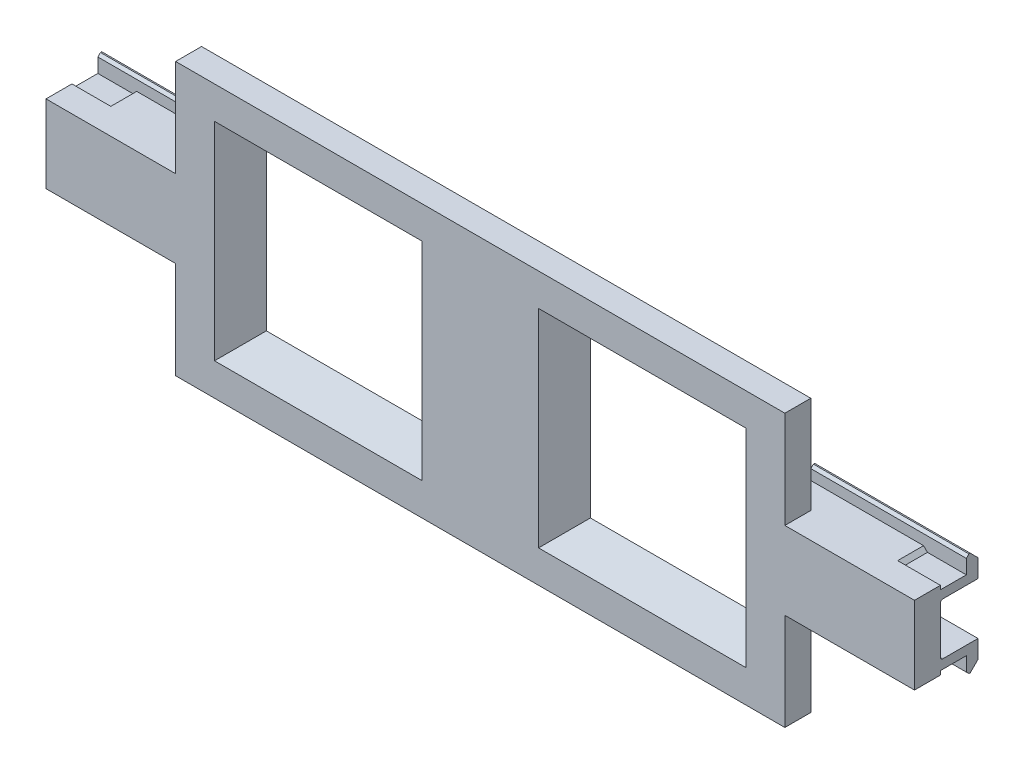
ISO-10303-21;
HEADER;
FILE_DESCRIPTION(('STEP AP214'),'2;1');
FILE_NAME('part.step','',(''),(''),'','','');
FILE_SCHEMA(('AUTOMOTIVE_DESIGN { 1 0 10303 214 1 1 1 1 }'));
ENDSEC;
DATA;
#1=APPLICATION_CONTEXT('core data for automotive mechanical design processes');
#2=APPLICATION_PROTOCOL_DEFINITION('international standard','automotive_design',2000,#1);
#3=PRODUCT_CONTEXT('',#1,'mechanical');
#4=PRODUCT('Part','Part','',(#3));
#5=PRODUCT_RELATED_PRODUCT_CATEGORY('part','',(#4));
#6=PRODUCT_DEFINITION_FORMATION('','',#4);
#7=PRODUCT_DEFINITION_CONTEXT('part definition',#1,'design');
#8=PRODUCT_DEFINITION('design','',#6,#7);
#9=PRODUCT_DEFINITION_SHAPE('','',#8);
#10=(LENGTH_UNIT() NAMED_UNIT(*) SI_UNIT(.MILLI.,.METRE.));
#11=(NAMED_UNIT(*) PLANE_ANGLE_UNIT() SI_UNIT($,.RADIAN.));
#12=(NAMED_UNIT(*) SI_UNIT($,.STERADIAN.) SOLID_ANGLE_UNIT());
#13=UNCERTAINTY_MEASURE_WITH_UNIT(LENGTH_MEASURE(1.E-05),#10,'distance_accuracy_value','');
#14=(GEOMETRIC_REPRESENTATION_CONTEXT(3) GLOBAL_UNCERTAINTY_ASSIGNED_CONTEXT((#13)) GLOBAL_UNIT_ASSIGNED_CONTEXT((#10,
#11,#12)) REPRESENTATION_CONTEXT('',''));
#15=CARTESIAN_POINT('',(0.,0.,0.));
#16=DIRECTION('',(0.,0.,1.));
#17=DIRECTION('',(1.,0.,0.));
#18=AXIS2_PLACEMENT_3D('',#15,#16,#17);
#19=CARTESIAN_POINT('',(0.,0.,0.));
#20=DIRECTION('',(0.,0.,-1.));
#21=DIRECTION('',(-1.,0.,0.));
#22=AXIS2_PLACEMENT_3D('',#19,#20,#21);
#23=PLANE('',#22);
#24=DIRECTION('',(0.,1.,0.));
#25=VECTOR('',#24,1.);
#26=CARTESIAN_POINT('',(6.5,0.,0.));
#27=LINE('',#26,#25);
#28=CARTESIAN_POINT('',(6.5,-6.,0.));
#29=VERTEX_POINT('',#28);
#30=CARTESIAN_POINT('',(6.5,6.,0.));
#31=VERTEX_POINT('',#30);
#32=EDGE_CURVE('E516',#29,#31,#27,.T.);
#33=ORIENTED_EDGE('',*,*,#32,.F.);
#34=DIRECTION('',(-1.,0.,0.));
#35=VECTOR('',#34,1.);
#36=CARTESIAN_POINT('',(0.,-6.,0.));
#37=LINE('',#36,#35);
#38=CARTESIAN_POINT('',(18.5,-6.,0.));
#39=VERTEX_POINT('',#38);
#40=EDGE_CURVE('E503',#39,#29,#37,.T.);
#41=ORIENTED_EDGE('',*,*,#40,.F.);
#42=DIRECTION('',(0.,-1.,0.));
#43=VECTOR('',#42,1.);
#44=CARTESIAN_POINT('',(18.5,0.,0.));
#45=LINE('',#44,#43);
#46=CARTESIAN_POINT('',(18.5,6.,0.));
#47=VERTEX_POINT('',#46);
#48=EDGE_CURVE('E507',#47,#39,#45,.T.);
#49=ORIENTED_EDGE('',*,*,#48,.F.);
#50=DIRECTION('',(1.,0.,0.));
#51=VECTOR('',#50,1.);
#52=CARTESIAN_POINT('',(0.,6.,0.));
#53=LINE('',#52,#51);
#54=EDGE_CURVE('E512',#31,#47,#53,.T.);
#55=ORIENTED_EDGE('',*,*,#54,.F.);
#56=EDGE_LOOP('',(#33,#41,#49,#55));
#57=FACE_BOUND('',#56,.T.);
#58=DIRECTION('',(0.,1.,0.));
#59=VECTOR('',#58,1.);
#60=CARTESIAN_POINT('',(-21.5,-2.,0.));
#61=LINE('',#60,#59);
#62=CARTESIAN_POINT('',(-21.5,-3.,0.));
#63=VERTEX_POINT('',#62);
#64=CARTESIAN_POINT('',(-21.5,-1.8,0.));
#65=VERTEX_POINT('',#64);
#66=EDGE_CURVE('E548',#63,#65,#61,.T.);
#67=ORIENTED_EDGE('',*,*,#66,.T.);
#68=DIRECTION('',(1.,0.,0.));
#69=VECTOR('',#68,1.);
#70=CARTESIAN_POINT('',(0.,-1.8,0.));
#71=LINE('',#70,#69);
#72=CARTESIAN_POINT('',(-33.3,-1.8,0.));
#73=VERTEX_POINT('',#72);
#74=EDGE_CURVE('E1133',#65,#73,#71,.F.);
#75=ORIENTED_EDGE('',*,*,#74,.T.);
#76=DIRECTION('',(0.,-1.,0.));
#77=VECTOR('',#76,1.);
#78=CARTESIAN_POINT('',(-33.3,2.,0.));
#79=LINE('',#78,#77);
#80=CARTESIAN_POINT('',(-33.3,1.8,0.));
#81=VERTEX_POINT('',#80);
#82=EDGE_CURVE('E1037',#73,#81,#79,.F.);
#83=ORIENTED_EDGE('',*,*,#82,.T.);
#84=DIRECTION('',(1.,0.,0.));
#85=VECTOR('',#84,1.);
#86=CARTESIAN_POINT('',(-21.5,1.8,0.));
#87=LINE('',#86,#85);
#88=CARTESIAN_POINT('',(-21.5,1.8,0.));
#89=VERTEX_POINT('',#88);
#90=EDGE_CURVE('E1033',#81,#89,#87,.T.);
#91=ORIENTED_EDGE('',*,*,#90,.T.);
#92=DIRECTION('',(0.,-1.,0.));
#93=VECTOR('',#92,1.);
#94=CARTESIAN_POINT('',(-21.5,2.,0.));
#95=LINE('',#94,#93);
#96=CARTESIAN_POINT('',(-21.5,3.,0.));
#97=VERTEX_POINT('',#96);
#98=EDGE_CURVE('E718',#97,#89,#95,.T.);
#99=ORIENTED_EDGE('',*,*,#98,.F.);
#100=DIRECTION('',(1.,0.,0.));
#101=VECTOR('',#100,1.);
#102=CARTESIAN_POINT('',(0.,3.,0.));
#103=LINE('',#102,#101);
#104=CARTESIAN_POINT('',(-23.5,3.,0.));
#105=VERTEX_POINT('',#104);
#106=EDGE_CURVE('E978',#105,#97,#103,.T.);
#107=ORIENTED_EDGE('',*,*,#106,.F.);
#108=DIRECTION('',(0.,-1.,0.));
#109=VECTOR('',#108,1.);
#110=CARTESIAN_POINT('',(-23.5,10.5,0.));
#111=LINE('',#110,#109);
#112=CARTESIAN_POINT('',(-23.5,10.5,0.));
#113=VERTEX_POINT('',#112);
#114=EDGE_CURVE('E805',#113,#105,#111,.T.);
#115=ORIENTED_EDGE('',*,*,#114,.F.);
#116=DIRECTION('',(-1.,0.,0.));
#117=VECTOR('',#116,1.);
#118=CARTESIAN_POINT('',(-23.5,10.5,0.));
#119=LINE('',#118,#117);
#120=CARTESIAN_POINT('',(23.5,10.5,0.));
#121=VERTEX_POINT('',#120);
#122=EDGE_CURVE('E818',#121,#113,#119,.T.);
#123=ORIENTED_EDGE('',*,*,#122,.F.);
#124=DIRECTION('',(0.,1.,0.));
#125=VECTOR('',#124,1.);
#126=CARTESIAN_POINT('',(23.5,10.5,0.));
#127=LINE('',#126,#125);
#128=CARTESIAN_POINT('',(23.5,3.,0.));
#129=VERTEX_POINT('',#128);
#130=EDGE_CURVE('E868',#129,#121,#127,.T.);
#131=ORIENTED_EDGE('',*,*,#130,.F.);
#132=DIRECTION('',(1.,0.,0.));
#133=VECTOR('',#132,1.);
#134=CARTESIAN_POINT('',(21.5,3.,0.));
#135=LINE('',#134,#133);
#136=CARTESIAN_POINT('',(21.3,3.,0.));
#137=VERTEX_POINT('',#136);
#138=EDGE_CURVE('E802',#137,#129,#135,.T.);
#139=ORIENTED_EDGE('',*,*,#138,.F.);
#140=DIRECTION('',(0.,-1.,0.));
#141=VECTOR('',#140,1.);
#142=CARTESIAN_POINT('',(21.3,2.,0.));
#143=LINE('',#142,#141);
#144=CARTESIAN_POINT('',(21.3,1.8,0.));
#145=VERTEX_POINT('',#144);
#146=EDGE_CURVE('E949',#137,#145,#143,.T.);
#147=ORIENTED_EDGE('',*,*,#146,.T.);
#148=DIRECTION('',(1.,0.,0.));
#149=VECTOR('',#148,1.);
#150=CARTESIAN_POINT('',(33.5,1.8,0.));
#151=LINE('',#150,#149);
#152=CARTESIAN_POINT('',(33.5,1.8,0.));
#153=VERTEX_POINT('',#152);
#154=EDGE_CURVE('E945',#145,#153,#151,.T.);
#155=ORIENTED_EDGE('',*,*,#154,.T.);
#156=DIRECTION('',(0.,1.,0.));
#157=VECTOR('',#156,1.);
#158=CARTESIAN_POINT('',(33.5,3.,0.));
#159=LINE('',#158,#157);
#160=CARTESIAN_POINT('',(33.5,-1.8,0.));
#161=VERTEX_POINT('',#160);
#162=EDGE_CURVE('E865',#161,#153,#159,.T.);
#163=ORIENTED_EDGE('',*,*,#162,.F.);
#164=DIRECTION('',(1.,0.,0.));
#165=VECTOR('',#164,1.);
#166=CARTESIAN_POINT('',(0.,-1.8,0.));
#167=LINE('',#166,#165);
#168=CARTESIAN_POINT('',(21.3,-1.8,0.));
#169=VERTEX_POINT('',#168);
#170=EDGE_CURVE('E1085',#161,#169,#167,.F.);
#171=ORIENTED_EDGE('',*,*,#170,.T.);
#172=DIRECTION('',(0.,1.,0.));
#173=VECTOR('',#172,1.);
#174=CARTESIAN_POINT('',(21.3,-3.,0.));
#175=LINE('',#174,#173);
#176=CARTESIAN_POINT('',(21.3,-3.,0.));
#177=VERTEX_POINT('',#176);
#178=EDGE_CURVE('E1088',#169,#177,#175,.F.);
#179=ORIENTED_EDGE('',*,*,#178,.T.);
#180=DIRECTION('',(1.,0.,0.));
#181=VECTOR('',#180,1.);
#182=CARTESIAN_POINT('',(21.5,-3.,0.));
#183=LINE('',#182,#181);
#184=CARTESIAN_POINT('',(23.5,-3.,0.));
#185=VERTEX_POINT('',#184);
#186=EDGE_CURVE('E650',#177,#185,#183,.T.);
#187=ORIENTED_EDGE('',*,*,#186,.T.);
#188=DIRECTION('',(0.,1.,0.));
#189=VECTOR('',#188,1.);
#190=CARTESIAN_POINT('',(23.5,-3.,0.));
#191=LINE('',#190,#189);
#192=CARTESIAN_POINT('',(23.5,-10.5,0.));
#193=VERTEX_POINT('',#192);
#194=EDGE_CURVE('E861',#193,#185,#191,.T.);
#195=ORIENTED_EDGE('',*,*,#194,.F.);
#196=DIRECTION('',(1.,0.,0.));
#197=VECTOR('',#196,1.);
#198=CARTESIAN_POINT('',(-23.5,-10.5,0.));
#199=LINE('',#198,#197);
#200=CARTESIAN_POINT('',(-23.5,-10.5,0.));
#201=VERTEX_POINT('',#200);
#202=EDGE_CURVE('E858',#201,#193,#199,.T.);
#203=ORIENTED_EDGE('',*,*,#202,.F.);
#204=DIRECTION('',(0.,-1.,0.));
#205=VECTOR('',#204,1.);
#206=CARTESIAN_POINT('',(-23.5,-3.,0.));
#207=LINE('',#206,#205);
#208=CARTESIAN_POINT('',(-23.5,-3.,0.));
#209=VERTEX_POINT('',#208);
#210=EDGE_CURVE('E855',#209,#201,#207,.T.);
#211=ORIENTED_EDGE('',*,*,#210,.F.);
#212=DIRECTION('',(1.,0.,0.));
#213=VECTOR('',#212,1.);
#214=CARTESIAN_POINT('',(-33.5,-3.,0.));
#215=LINE('',#214,#213);
#216=EDGE_CURVE('E569',#209,#63,#215,.T.);
#217=ORIENTED_EDGE('',*,*,#216,.T.);
#218=EDGE_LOOP('',(#67,#75,#83,#91,#99,#107,#115,#123,#131,#139,#147,#155,#163,#171,#179,#187,
#195,#203,#211,#217));
#219=FACE_BOUND('',#218,.T.);
#220=DIRECTION('',(1.,0.,0.));
#221=VECTOR('',#220,1.);
#222=CARTESIAN_POINT('',(0.,-6.,0.));
#223=LINE('',#222,#221);
#224=CARTESIAN_POINT('',(-18.5,-6.,0.));
#225=VERTEX_POINT('',#224);
#226=CARTESIAN_POINT('',(-6.5,-6.,0.));
#227=VERTEX_POINT('',#226);
#228=EDGE_CURVE('E492',#225,#227,#223,.T.);
#229=ORIENTED_EDGE('',*,*,#228,.T.);
#230=DIRECTION('',(0.,1.,0.));
#231=VECTOR('',#230,1.);
#232=CARTESIAN_POINT('',(-6.5,0.,0.));
#233=LINE('',#232,#231);
#234=CARTESIAN_POINT('',(-6.5,6.,0.));
#235=VERTEX_POINT('',#234);
#236=EDGE_CURVE('E476',#227,#235,#233,.T.);
#237=ORIENTED_EDGE('',*,*,#236,.T.);
#238=DIRECTION('',(-1.,0.,0.));
#239=VECTOR('',#238,1.);
#240=CARTESIAN_POINT('',(0.,6.,0.));
#241=LINE('',#240,#239);
#242=CARTESIAN_POINT('',(-18.5,6.,0.));
#243=VERTEX_POINT('',#242);
#244=EDGE_CURVE('E483',#235,#243,#241,.T.);
#245=ORIENTED_EDGE('',*,*,#244,.T.);
#246=DIRECTION('',(0.,-1.,0.));
#247=VECTOR('',#246,1.);
#248=CARTESIAN_POINT('',(-18.5,0.,0.));
#249=LINE('',#248,#247);
#250=EDGE_CURVE('E489',#243,#225,#249,.T.);
#251=ORIENTED_EDGE('',*,*,#250,.T.);
#252=EDGE_LOOP('',(#229,#237,#245,#251));
#253=FACE_BOUND('',#252,.T.);
#254=ADVANCED_FACE('F45',(#57,#219,#253),#23,.T.);
#255=CARTESIAN_POINT('',(0.,0.,2.));
#256=DIRECTION('',(0.,0.,-1.));
#257=DIRECTION('',(-1.,0.,0.));
#258=AXIS2_PLACEMENT_3D('',#255,#256,#257);
#259=PLANE('',#258);
#260=DIRECTION('',(1.,0.,0.));
#261=VECTOR('',#260,1.);
#262=CARTESIAN_POINT('',(-6.5,8.00000000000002,2.));
#263=LINE('',#262,#261);
#264=CARTESIAN_POINT('',(-20.5,8.00000000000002,2.));
#265=VERTEX_POINT('',#264);
#266=CARTESIAN_POINT('',(-4.49999999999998,8.00000000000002,2.));
#267=VERTEX_POINT('',#266);
#268=EDGE_CURVE('E1160',#265,#267,#263,.T.);
#269=ORIENTED_EDGE('',*,*,#268,.T.);
#270=DIRECTION('',(0.,-1.,0.));
#271=VECTOR('',#270,1.);
#272=CARTESIAN_POINT('',(-4.49999999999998,-6.,2.));
#273=LINE('',#272,#271);
#274=CARTESIAN_POINT('',(-4.49999999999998,-8.00000000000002,2.));
#275=VERTEX_POINT('',#274);
#276=EDGE_CURVE('E11',#267,#275,#273,.T.);
#277=ORIENTED_EDGE('',*,*,#276,.T.);
#278=DIRECTION('',(-1.,0.,0.));
#279=VECTOR('',#278,1.);
#280=CARTESIAN_POINT('',(-18.5,-8.00000000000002,2.));
#281=LINE('',#280,#279);
#282=CARTESIAN_POINT('',(-20.5,-8.00000000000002,2.));
#283=VERTEX_POINT('',#282);
#284=EDGE_CURVE('E56',#275,#283,#281,.T.);
#285=ORIENTED_EDGE('',*,*,#284,.T.);
#286=DIRECTION('',(0.,1.,0.));
#287=VECTOR('',#286,1.);
#288=CARTESIAN_POINT('',(-20.5,6.,2.));
#289=LINE('',#288,#287);
#290=EDGE_CURVE('E1173',#283,#265,#289,.T.);
#291=ORIENTED_EDGE('',*,*,#290,.T.);
#292=EDGE_LOOP('',(#269,#277,#285,#291));
#293=FACE_BOUND('',#292,.T.);
#294=DIRECTION('',(0.,-1.,0.));
#295=VECTOR('',#294,1.);
#296=CARTESIAN_POINT('',(-23.5,10.5,2.));
#297=LINE('',#296,#295);
#298=CARTESIAN_POINT('',(-23.5,10.5,2.));
#299=VERTEX_POINT('',#298);
#300=CARTESIAN_POINT('',(-23.5,3.,2.));
#301=VERTEX_POINT('',#300);
#302=EDGE_CURVE('E813',#299,#301,#297,.T.);
#303=ORIENTED_EDGE('',*,*,#302,.T.);
#304=DIRECTION('',(-1.,0.,0.));
#305=VECTOR('',#304,1.);
#306=CARTESIAN_POINT('',(-23.5,3.,2.));
#307=LINE('',#306,#305);
#308=CARTESIAN_POINT('',(-33.5,3.,2.));
#309=VERTEX_POINT('',#308);
#310=EDGE_CURVE('E817',#301,#309,#307,.T.);
#311=ORIENTED_EDGE('',*,*,#310,.T.);
#312=DIRECTION('',(0.,-1.,0.));
#313=VECTOR('',#312,1.);
#314=CARTESIAN_POINT('',(-33.5,3.,2.));
#315=LINE('',#314,#313);
#316=CARTESIAN_POINT('',(-33.5,-3.,2.));
#317=VERTEX_POINT('',#316);
#318=EDGE_CURVE('E821',#309,#317,#315,.T.);
#319=ORIENTED_EDGE('',*,*,#318,.T.);
#320=DIRECTION('',(1.,0.,0.));
#321=VECTOR('',#320,1.);
#322=CARTESIAN_POINT('',(-23.5,-3.,2.));
#323=LINE('',#322,#321);
#324=CARTESIAN_POINT('',(-23.5,-3.,2.));
#325=VERTEX_POINT('',#324);
#326=EDGE_CURVE('E824',#317,#325,#323,.T.);
#327=ORIENTED_EDGE('',*,*,#326,.T.);
#328=DIRECTION('',(0.,-1.,0.));
#329=VECTOR('',#328,1.);
#330=CARTESIAN_POINT('',(-23.5,-3.,2.));
#331=LINE('',#330,#329);
#332=CARTESIAN_POINT('',(-23.5,-10.5,2.));
#333=VERTEX_POINT('',#332);
#334=EDGE_CURVE('E827',#325,#333,#331,.T.);
#335=ORIENTED_EDGE('',*,*,#334,.T.);
#336=DIRECTION('',(1.,0.,0.));
#337=VECTOR('',#336,1.);
#338=CARTESIAN_POINT('',(-23.5,-10.5,2.));
#339=LINE('',#338,#337);
#340=CARTESIAN_POINT('',(23.5,-10.5,2.));
#341=VERTEX_POINT('',#340);
#342=EDGE_CURVE('E830',#333,#341,#339,.T.);
#343=ORIENTED_EDGE('',*,*,#342,.T.);
#344=DIRECTION('',(0.,1.,0.));
#345=VECTOR('',#344,1.);
#346=CARTESIAN_POINT('',(23.5,-3.,2.));
#347=LINE('',#346,#345);
#348=CARTESIAN_POINT('',(23.5,-3.,2.));
#349=VERTEX_POINT('',#348);
#350=EDGE_CURVE('E833',#341,#349,#347,.T.);
#351=ORIENTED_EDGE('',*,*,#350,.T.);
#352=DIRECTION('',(1.,0.,0.));
#353=VECTOR('',#352,1.);
#354=CARTESIAN_POINT('',(23.5,-3.,2.));
#355=LINE('',#354,#353);
#356=CARTESIAN_POINT('',(33.5,-3.,2.));
#357=VERTEX_POINT('',#356);
#358=EDGE_CURVE('E836',#349,#357,#355,.T.);
#359=ORIENTED_EDGE('',*,*,#358,.T.);
#360=DIRECTION('',(0.,1.,0.));
#361=VECTOR('',#360,1.);
#362=CARTESIAN_POINT('',(33.5,3.,2.));
#363=LINE('',#362,#361);
#364=CARTESIAN_POINT('',(33.5,3.,2.));
#365=VERTEX_POINT('',#364);
#366=EDGE_CURVE('E839',#357,#365,#363,.T.);
#367=ORIENTED_EDGE('',*,*,#366,.T.);
#368=DIRECTION('',(-1.,0.,0.));
#369=VECTOR('',#368,1.);
#370=CARTESIAN_POINT('',(23.5,3.,2.));
#371=LINE('',#370,#369);
#372=CARTESIAN_POINT('',(23.5,3.,2.));
#373=VERTEX_POINT('',#372);
#374=EDGE_CURVE('E842',#365,#373,#371,.T.);
#375=ORIENTED_EDGE('',*,*,#374,.T.);
#376=DIRECTION('',(0.,1.,0.));
#377=VECTOR('',#376,1.);
#378=CARTESIAN_POINT('',(23.5,10.5,2.));
#379=LINE('',#378,#377);
#380=CARTESIAN_POINT('',(23.5,10.5,2.));
#381=VERTEX_POINT('',#380);
#382=EDGE_CURVE('E845',#373,#381,#379,.T.);
#383=ORIENTED_EDGE('',*,*,#382,.T.);
#384=DIRECTION('',(-1.,0.,0.));
#385=VECTOR('',#384,1.);
#386=CARTESIAN_POINT('',(-23.5,10.5,2.));
#387=LINE('',#386,#385);
#388=EDGE_CURVE('E848',#381,#299,#387,.T.);
#389=ORIENTED_EDGE('',*,*,#388,.T.);
#390=EDGE_LOOP('',(#303,#311,#319,#327,#335,#343,#351,#359,#367,#375,#383,#389));
#391=FACE_BOUND('',#390,.T.);
#392=DIRECTION('',(-1.,0.,0.));
#393=VECTOR('',#392,1.);
#394=CARTESIAN_POINT('',(0.,-8.00000000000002,2.));
#395=LINE('',#394,#393);
#396=CARTESIAN_POINT('',(20.5,-8.00000000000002,2.));
#397=VERTEX_POINT('',#396);
#398=CARTESIAN_POINT('',(4.49999999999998,-8.00000000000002,2.));
#399=VERTEX_POINT('',#398);
#400=EDGE_CURVE('E1154',#397,#399,#395,.T.);
#401=ORIENTED_EDGE('',*,*,#400,.T.);
#402=DIRECTION('',(0.,1.,0.));
#403=VECTOR('',#402,1.);
#404=CARTESIAN_POINT('',(4.49999999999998,0.,2.));
#405=LINE('',#404,#403);
#406=CARTESIAN_POINT('',(4.49999999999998,8.00000000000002,2.));
#407=VERTEX_POINT('',#406);
#408=EDGE_CURVE('E1157',#399,#407,#405,.T.);
#409=ORIENTED_EDGE('',*,*,#408,.T.);
#410=DIRECTION('',(1.,0.,0.));
#411=VECTOR('',#410,1.);
#412=CARTESIAN_POINT('',(0.,8.00000000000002,2.));
#413=LINE('',#412,#411);
#414=CARTESIAN_POINT('',(20.5,8.00000000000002,2.));
#415=VERTEX_POINT('',#414);
#416=EDGE_CURVE('E1148',#407,#415,#413,.T.);
#417=ORIENTED_EDGE('',*,*,#416,.T.);
#418=DIRECTION('',(0.,-1.,0.));
#419=VECTOR('',#418,1.);
#420=CARTESIAN_POINT('',(20.5,0.,2.));
#421=LINE('',#420,#419);
#422=EDGE_CURVE('E1151',#415,#397,#421,.T.);
#423=ORIENTED_EDGE('',*,*,#422,.T.);
#424=EDGE_LOOP('',(#401,#409,#417,#423));
#425=FACE_BOUND('',#424,.T.);
#426=ADVANCED_FACE('F1187',(#293,#391,#425),#259,.F.);
#427=CARTESIAN_POINT('',(-33.5,-2.,0.));
#428=DIRECTION('',(0.,0.,-1.));
#429=DIRECTION('',(-1.,0.,0.));
#430=AXIS2_PLACEMENT_3D('',#427,#428,#429);
#431=PLANE('',#430);
#432=DIRECTION('',(-1.,0.,0.));
#433=VECTOR('',#432,1.);
#434=CARTESIAN_POINT('',(-30.5,-2.7,0.));
#435=LINE('',#434,#433);
#436=CARTESIAN_POINT('',(-33.3,-2.7,0.));
#437=VERTEX_POINT('',#436);
#438=CARTESIAN_POINT('',(-33.5,-2.7,0.));
#439=VERTEX_POINT('',#438);
#440=EDGE_CURVE('E534',#437,#439,#435,.T.);
#441=ORIENTED_EDGE('',*,*,#440,.F.);
#442=EDGE_CURVE('E1042',#437,#73,#79,.F.);
#443=ORIENTED_EDGE('',*,*,#442,.T.);
#444=DIRECTION('',(1.,0.,0.));
#445=VECTOR('',#444,1.);
#446=CARTESIAN_POINT('',(-33.4,-1.8,0.));
#447=LINE('',#446,#445);
#448=CARTESIAN_POINT('',(-33.5,-1.80000447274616,0.));
#449=VERTEX_POINT('',#448);
#450=EDGE_CURVE('E1141',#73,#449,#447,.F.);
#451=ORIENTED_EDGE('',*,*,#450,.T.);
#452=DIRECTION('',(0.,1.,0.));
#453=VECTOR('',#452,1.);
#454=CARTESIAN_POINT('',(-33.5,-2.,0.));
#455=LINE('',#454,#453);
#456=EDGE_CURVE('E551',#439,#449,#455,.T.);
#457=ORIENTED_EDGE('',*,*,#456,.F.);
#458=EDGE_LOOP('',(#441,#443,#451,#457));
#459=FACE_BOUND('',#458,.T.);
#460=ADVANCED_FACE('F1190',(#459),#431,.F.);
#461=CARTESIAN_POINT('',(23.5,-3.,2.));
#462=DIRECTION('',(0.,1.,0.));
#463=DIRECTION('',(0.,0.,1.));
#464=AXIS2_PLACEMENT_3D('',#461,#462,#463);
#465=PLANE('',#464);
#466=DIRECTION('',(0.,0.,1.));
#467=VECTOR('',#466,1.);
#468=CARTESIAN_POINT('',(30.5,-3.,-2.));
#469=LINE('',#468,#467);
#470=CARTESIAN_POINT('',(30.5,-3.,-2.));
#471=VERTEX_POINT('',#470);
#472=CARTESIAN_POINT('',(30.5,-3.,0.));
#473=VERTEX_POINT('',#472);
#474=EDGE_CURVE('E605',#471,#473,#469,.T.);
#475=ORIENTED_EDGE('',*,*,#474,.T.);
#476=DIRECTION('',(1.,0.,0.));
#477=VECTOR('',#476,1.);
#478=CARTESIAN_POINT('',(30.5,-3.,0.));
#479=LINE('',#478,#477);
#480=CARTESIAN_POINT('',(33.5,-3.,0.));
#481=VERTEX_POINT('',#480);
#482=EDGE_CURVE('E594',#473,#481,#479,.T.);
#483=ORIENTED_EDGE('',*,*,#482,.T.);
#484=DIRECTION('',(0.,0.,-1.));
#485=VECTOR('',#484,1.);
#486=CARTESIAN_POINT('',(33.5,-3.,2.));
#487=LINE('',#486,#485);
#488=EDGE_CURVE('E888',#357,#481,#487,.T.);
#489=ORIENTED_EDGE('',*,*,#488,.F.);
#490=ORIENTED_EDGE('',*,*,#358,.F.);
#491=DIRECTION('',(0.,0.,-1.));
#492=VECTOR('',#491,1.);
#493=CARTESIAN_POINT('',(23.5,-3.,2.));
#494=LINE('',#493,#492);
#495=EDGE_CURVE('E892',#349,#185,#494,.T.);
#496=ORIENTED_EDGE('',*,*,#495,.T.);
#497=ORIENTED_EDGE('',*,*,#186,.F.);
#498=CARTESIAN_POINT('',(21.3,-3.,-0.2));
#499=DIRECTION('',(0.,1.,0.));
#500=DIRECTION('',(0.,0.,1.));
#501=AXIS2_PLACEMENT_3D('',#498,#499,#500);
#502=CIRCLE('',#501,0.2);
#503=CARTESIAN_POINT('',(21.5,-3.,-0.2));
#504=VERTEX_POINT('',#503);
#505=EDGE_CURVE('E1095',#177,#504,#502,.T.);
#506=ORIENTED_EDGE('',*,*,#505,.T.);
#507=DIRECTION('',(0.,0.,1.));
#508=VECTOR('',#507,1.);
#509=CARTESIAN_POINT('',(21.5,-3.,0.));
#510=LINE('',#509,#508);
#511=CARTESIAN_POINT('',(21.5,-3.,-2.));
#512=VERTEX_POINT('',#511);
#513=EDGE_CURVE('E631',#512,#504,#510,.T.);
#514=ORIENTED_EDGE('',*,*,#513,.F.);
#515=DIRECTION('',(1.,0.,0.));
#516=VECTOR('',#515,1.);
#517=CARTESIAN_POINT('',(21.5,-3.,-2.));
#518=LINE('',#517,#516);
#519=EDGE_CURVE('E669',#512,#471,#518,.T.);
#520=ORIENTED_EDGE('',*,*,#519,.T.);
#521=EDGE_LOOP('',(#475,#483,#489,#490,#496,#497,#506,#514,#520));
#522=FACE_BOUND('',#521,.T.);
#523=ADVANCED_FACE('F1251',(#522),#465,.F.);
#524=CARTESIAN_POINT('',(33.5,3.,2.));
#525=DIRECTION('',(-1.,0.,0.));
#526=DIRECTION('',(0.,0.,1.));
#527=AXIS2_PLACEMENT_3D('',#524,#525,#526);
#528=PLANE('',#527);
#529=DIRECTION('',(0.,0.,-1.));
#530=VECTOR('',#529,1.);
#531=CARTESIAN_POINT('',(33.5,-2.7,0.));
#532=LINE('',#531,#530);
#533=CARTESIAN_POINT('',(33.5,-2.7,0.));
#534=VERTEX_POINT('',#533);
#535=CARTESIAN_POINT('',(33.5,-2.7,-2.));
#536=VERTEX_POINT('',#535);
#537=EDGE_CURVE('E600',#534,#536,#532,.T.);
#538=ORIENTED_EDGE('',*,*,#537,.T.);
#539=DIRECTION('',(0.,1.,0.));
#540=VECTOR('',#539,1.);
#541=CARTESIAN_POINT('',(33.5,-3.,-2.));
#542=LINE('',#541,#540);
#543=CARTESIAN_POINT('',(33.5,-3.8,-2.));
#544=VERTEX_POINT('',#543);
#545=EDGE_CURVE('E651',#544,#536,#542,.T.);
#546=ORIENTED_EDGE('',*,*,#545,.F.);
#547=DIRECTION('',(0.,0.70710678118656,0.707106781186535));
#548=VECTOR('',#547,1.);
#549=CARTESIAN_POINT('',(33.5,-3.8,-2.));
#550=LINE('',#549,#548);
#551=CARTESIAN_POINT('',(33.5,-4.,-2.19999999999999));
#552=VERTEX_POINT('',#551);
#553=EDGE_CURVE('E1072',#544,#552,#550,.F.);
#554=ORIENTED_EDGE('',*,*,#553,.T.);
#555=DIRECTION('',(0.,0.,1.));
#556=VECTOR('',#555,1.);
#557=CARTESIAN_POINT('',(33.5,-4.,-2.));
#558=LINE('',#557,#556);
#559=CARTESIAN_POINT('',(33.5,-4.,-2.3));
#560=VERTEX_POINT('',#559);
#561=EDGE_CURVE('E654',#560,#552,#558,.T.);
#562=ORIENTED_EDGE('',*,*,#561,.F.);
#563=DIRECTION('',(0.,-0.707106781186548,0.707106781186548));
#564=VECTOR('',#563,1.);
#565=CARTESIAN_POINT('',(33.5,-4.,-2.3));
#566=LINE('',#565,#564);
#567=CARTESIAN_POINT('',(33.5,-3.4,-2.9));
#568=VERTEX_POINT('',#567);
#569=EDGE_CURVE('E1059',#560,#568,#566,.F.);
#570=ORIENTED_EDGE('',*,*,#569,.T.);
#571=DIRECTION('',(0.,-1.,0.));
#572=VECTOR('',#571,1.);
#573=CARTESIAN_POINT('',(33.5,-4.,-2.9));
#574=LINE('',#573,#572);
#575=CARTESIAN_POINT('',(33.5,-2.,-2.9));
#576=VERTEX_POINT('',#575);
#577=EDGE_CURVE('E658',#576,#568,#574,.T.);
#578=ORIENTED_EDGE('',*,*,#577,.F.);
#579=DIRECTION('',(0.,0.,-1.));
#580=VECTOR('',#579,1.);
#581=CARTESIAN_POINT('',(33.5,-2.,-2.9));
#582=LINE('',#581,#580);
#583=CARTESIAN_POINT('',(33.5,-2.,-0.2));
#584=VERTEX_POINT('',#583);
#585=EDGE_CURVE('E636',#584,#576,#582,.T.);
#586=ORIENTED_EDGE('',*,*,#585,.F.);
#587=CARTESIAN_POINT('',(33.5,-1.8,-0.2));
#588=DIRECTION('',(-1.,0.,0.));
#589=DIRECTION('',(0.,0.,1.));
#590=AXIS2_PLACEMENT_3D('',#587,#588,#589);
#591=CIRCLE('',#590,0.2);
#592=EDGE_CURVE('E1098',#584,#161,#591,.T.);
#593=ORIENTED_EDGE('',*,*,#592,.T.);
#594=ORIENTED_EDGE('',*,*,#162,.T.);
#595=CARTESIAN_POINT('',(33.5,1.8,-0.2));
#596=DIRECTION('',(-1.,0.,0.));
#597=DIRECTION('',(0.,0.,1.));
#598=AXIS2_PLACEMENT_3D('',#595,#596,#597);
#599=CIRCLE('',#598,0.2);
#600=CARTESIAN_POINT('',(33.5,2.,-0.2));
#601=VERTEX_POINT('',#600);
#602=EDGE_CURVE('E963',#153,#601,#599,.T.);
#603=ORIENTED_EDGE('',*,*,#602,.T.);
#604=DIRECTION('',(0.,0.,-1.));
#605=VECTOR('',#604,1.);
#606=CARTESIAN_POINT('',(33.5,2.,-2.9));
#607=LINE('',#606,#605);
#608=CARTESIAN_POINT('',(33.5,2.,-2.9));
#609=VERTEX_POINT('',#608);
#610=EDGE_CURVE('E789',#601,#609,#607,.T.);
#611=ORIENTED_EDGE('',*,*,#610,.T.);
#612=DIRECTION('',(0.,1.,0.));
#613=VECTOR('',#612,1.);
#614=CARTESIAN_POINT('',(33.5,4.,-2.9));
#615=LINE('',#614,#613);
#616=CARTESIAN_POINT('',(33.5,3.4,-2.9));
#617=VERTEX_POINT('',#616);
#618=EDGE_CURVE('E792',#609,#617,#615,.T.);
#619=ORIENTED_EDGE('',*,*,#618,.T.);
#620=DIRECTION('',(0.,-0.707106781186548,-0.707106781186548));
#621=VECTOR('',#620,1.);
#622=CARTESIAN_POINT('',(33.5,3.4,-2.9));
#623=LINE('',#622,#621);
#624=CARTESIAN_POINT('',(33.5,4.,-2.3));
#625=VERTEX_POINT('',#624);
#626=EDGE_CURVE('E923',#617,#625,#623,.F.);
#627=ORIENTED_EDGE('',*,*,#626,.T.);
#628=DIRECTION('',(0.,0.,1.));
#629=VECTOR('',#628,1.);
#630=CARTESIAN_POINT('',(33.5,4.,-2.));
#631=LINE('',#630,#629);
#632=CARTESIAN_POINT('',(33.5,4.,-2.19999999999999));
#633=VERTEX_POINT('',#632);
#634=EDGE_CURVE('E796',#625,#633,#631,.T.);
#635=ORIENTED_EDGE('',*,*,#634,.T.);
#636=DIRECTION('',(0.,0.70710678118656,-0.707106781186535));
#637=VECTOR('',#636,1.);
#638=CARTESIAN_POINT('',(33.5,4.,-2.19999999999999));
#639=LINE('',#638,#637);
#640=CARTESIAN_POINT('',(33.5,3.8,-2.));
#641=VERTEX_POINT('',#640);
#642=EDGE_CURVE('E936',#633,#641,#639,.F.);
#643=ORIENTED_EDGE('',*,*,#642,.T.);
#644=DIRECTION('',(0.,-1.,0.));
#645=VECTOR('',#644,1.);
#646=CARTESIAN_POINT('',(33.5,3.,-2.));
#647=LINE('',#646,#645);
#648=CARTESIAN_POINT('',(33.5,2.7,-2.));
#649=VERTEX_POINT('',#648);
#650=EDGE_CURVE('E773',#641,#649,#647,.T.);
#651=ORIENTED_EDGE('',*,*,#650,.T.);
#652=DIRECTION('',(0.,0.,-1.));
#653=VECTOR('',#652,1.);
#654=CARTESIAN_POINT('',(33.5,2.7,0.));
#655=LINE('',#654,#653);
#656=CARTESIAN_POINT('',(33.5,2.7,0.));
#657=VERTEX_POINT('',#656);
#658=EDGE_CURVE('E746',#657,#649,#655,.T.);
#659=ORIENTED_EDGE('',*,*,#658,.F.);
#660=DIRECTION('',(0.,1.,0.));
#661=VECTOR('',#660,1.);
#662=CARTESIAN_POINT('',(33.5,2.7,0.));
#663=LINE('',#662,#661);
#664=CARTESIAN_POINT('',(33.5,3.,0.));
#665=VERTEX_POINT('',#664);
#666=EDGE_CURVE('E762',#657,#665,#663,.T.);
#667=ORIENTED_EDGE('',*,*,#666,.T.);
#668=DIRECTION('',(0.,0.,-1.));
#669=VECTOR('',#668,1.);
#670=CARTESIAN_POINT('',(33.5,3.,2.));
#671=LINE('',#670,#669);
#672=EDGE_CURVE('E884',#365,#665,#671,.T.);
#673=ORIENTED_EDGE('',*,*,#672,.F.);
#674=ORIENTED_EDGE('',*,*,#366,.F.);
#675=ORIENTED_EDGE('',*,*,#488,.T.);
#676=DIRECTION('',(0.,-1.,0.));
#677=VECTOR('',#676,1.);
#678=CARTESIAN_POINT('',(33.5,-2.7,0.));
#679=LINE('',#678,#677);
#680=EDGE_CURVE('E614',#534,#481,#679,.T.);
#681=ORIENTED_EDGE('',*,*,#680,.F.);
#682=EDGE_LOOP('',(#538,#546,#554,#562,#570,#578,#586,#593,#594,#603,#611,#619,#627,#635,#643,
#651,#659,#667,#673,#674,#675,#681));
#683=FACE_BOUND('',#682,.T.);
#684=ADVANCED_FACE('F1247',(#683),#528,.F.);
#685=CARTESIAN_POINT('',(-23.5,3.,2.));
#686=DIRECTION('',(0.,-1.,0.));
#687=DIRECTION('',(1.,0.,0.));
#688=AXIS2_PLACEMENT_3D('',#685,#686,#687);
#689=PLANE('',#688);
#690=DIRECTION('',(0.,0.,1.));
#691=VECTOR('',#690,1.);
#692=CARTESIAN_POINT('',(-30.5,3.,-2.));
#693=LINE('',#692,#691);
#694=CARTESIAN_POINT('',(-30.5,3.,-2.));
#695=VERTEX_POINT('',#694);
#696=CARTESIAN_POINT('',(-30.5,3.,0.));
#697=VERTEX_POINT('',#696);
#698=EDGE_CURVE('E680',#695,#697,#693,.T.);
#699=ORIENTED_EDGE('',*,*,#698,.T.);
#700=DIRECTION('',(-1.,0.,0.));
#701=VECTOR('',#700,1.);
#702=CARTESIAN_POINT('',(-30.5,3.,0.));
#703=LINE('',#702,#701);
#704=CARTESIAN_POINT('',(-33.5,3.,0.));
#705=VERTEX_POINT('',#704);
#706=EDGE_CURVE('E668',#697,#705,#703,.T.);
#707=ORIENTED_EDGE('',*,*,#706,.T.);
#708=DIRECTION('',(0.,0.,-1.));
#709=VECTOR('',#708,1.);
#710=CARTESIAN_POINT('',(-33.5,3.,2.));
#711=LINE('',#710,#709);
#712=EDGE_CURVE('E911',#309,#705,#711,.T.);
#713=ORIENTED_EDGE('',*,*,#712,.F.);
#714=ORIENTED_EDGE('',*,*,#310,.F.);
#715=DIRECTION('',(0.,0.,-1.));
#716=VECTOR('',#715,1.);
#717=CARTESIAN_POINT('',(-23.5,3.,2.));
#718=LINE('',#717,#716);
#719=EDGE_CURVE('E915',#301,#105,#718,.T.);
#720=ORIENTED_EDGE('',*,*,#719,.T.);
#721=ORIENTED_EDGE('',*,*,#106,.T.);
#722=DIRECTION('',(0.,0.,1.));
#723=VECTOR('',#722,1.);
#724=CARTESIAN_POINT('',(-21.5,3.,0.));
#725=LINE('',#724,#723);
#726=CARTESIAN_POINT('',(-21.5,3.,-2.));
#727=VERTEX_POINT('',#726);
#728=EDGE_CURVE('E710',#727,#97,#725,.T.);
#729=ORIENTED_EDGE('',*,*,#728,.F.);
#730=DIRECTION('',(1.,0.,0.));
#731=VECTOR('',#730,1.);
#732=CARTESIAN_POINT('',(-33.5,3.,-2.));
#733=LINE('',#732,#731);
#734=EDGE_CURVE('E740',#695,#727,#733,.T.);
#735=ORIENTED_EDGE('',*,*,#734,.F.);
#736=EDGE_LOOP('',(#699,#707,#713,#714,#720,#721,#729,#735));
#737=FACE_BOUND('',#736,.T.);
#738=ADVANCED_FACE('F1250',(#737),#689,.F.);
#739=CARTESIAN_POINT('',(-33.5,3.,2.));
#740=DIRECTION('',(1.,0.,0.));
#741=DIRECTION('',(0.,0.,-1.));
#742=AXIS2_PLACEMENT_3D('',#739,#740,#741);
#743=PLANE('',#742);
#744=DIRECTION('',(0.,0.,-1.));
#745=VECTOR('',#744,1.);
#746=CARTESIAN_POINT('',(-33.5,2.7,0.));
#747=LINE('',#746,#745);
#748=CARTESIAN_POINT('',(-33.5,2.7,0.));
#749=VERTEX_POINT('',#748);
#750=CARTESIAN_POINT('',(-33.5,2.7,-2.));
#751=VERTEX_POINT('',#750);
#752=EDGE_CURVE('E675',#749,#751,#747,.T.);
#753=ORIENTED_EDGE('',*,*,#752,.T.);
#754=DIRECTION('',(0.,-1.,0.));
#755=VECTOR('',#754,1.);
#756=CARTESIAN_POINT('',(-33.5,3.,-2.));
#757=LINE('',#756,#755);
#758=CARTESIAN_POINT('',(-33.5,3.8,-2.));
#759=VERTEX_POINT('',#758);
#760=EDGE_CURVE('E714',#759,#751,#757,.T.);
#761=ORIENTED_EDGE('',*,*,#760,.F.);
#762=DIRECTION('',(0.,-0.70710678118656,0.707106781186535));
#763=VECTOR('',#762,1.);
#764=CARTESIAN_POINT('',(-33.5,4.,-2.19999999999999));
#765=LINE('',#764,#763);
#766=CARTESIAN_POINT('',(-33.5,4.,-2.19999999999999));
#767=VERTEX_POINT('',#766);
#768=EDGE_CURVE('E1006',#759,#767,#765,.F.);
#769=ORIENTED_EDGE('',*,*,#768,.T.);
#770=DIRECTION('',(0.,0.,1.));
#771=VECTOR('',#770,1.);
#772=CARTESIAN_POINT('',(-33.5,4.,-2.));
#773=LINE('',#772,#771);
#774=CARTESIAN_POINT('',(-33.5,4.,-2.3));
#775=VERTEX_POINT('',#774);
#776=EDGE_CURVE('E709',#775,#767,#773,.T.);
#777=ORIENTED_EDGE('',*,*,#776,.F.);
#778=DIRECTION('',(0.,0.707106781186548,0.707106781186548));
#779=VECTOR('',#778,1.);
#780=CARTESIAN_POINT('',(-33.5,3.4,-2.9));
#781=LINE('',#780,#779);
#782=CARTESIAN_POINT('',(-33.5,3.4,-2.9));
#783=VERTEX_POINT('',#782);
#784=EDGE_CURVE('E992',#775,#783,#781,.F.);
#785=ORIENTED_EDGE('',*,*,#784,.T.);
#786=DIRECTION('',(0.,1.,0.));
#787=VECTOR('',#786,1.);
#788=CARTESIAN_POINT('',(-33.5,4.,-2.9));
#789=LINE('',#788,#787);
#790=CARTESIAN_POINT('',(-33.5,2.2,-2.9));
#791=VERTEX_POINT('',#790);
#792=EDGE_CURVE('E706',#791,#783,#789,.T.);
#793=ORIENTED_EDGE('',*,*,#792,.F.);
#794=DIRECTION('',(0.,0.,-1.));
#795=VECTOR('',#794,1.);
#796=CARTESIAN_POINT('',(-33.5,2.2,0.));
#797=LINE('',#796,#795);
#798=CARTESIAN_POINT('',(-33.5,2.2,-0.2));
#799=VERTEX_POINT('',#798);
#800=EDGE_CURVE('E1026',#791,#799,#797,.F.);
#801=ORIENTED_EDGE('',*,*,#800,.T.);
#802=CARTESIAN_POINT('',(-33.5,1.8,-0.2));
#803=DIRECTION('',(1.,0.,0.));
#804=DIRECTION('',(0.,0.,-1.));
#805=AXIS2_PLACEMENT_3D('',#802,#803,#804);
#806=CIRCLE('',#805,0.4);
#807=CARTESIAN_POINT('',(-33.5,1.8,0.2));
#808=VERTEX_POINT('',#807);
#809=EDGE_CURVE('E1022',#808,#799,#806,.F.);
#810=ORIENTED_EDGE('',*,*,#809,.F.);
#811=DIRECTION('',(0.,-1.,0.));
#812=VECTOR('',#811,1.);
#813=CARTESIAN_POINT('',(-33.5,-3.,0.2));
#814=LINE('',#813,#812);
#815=CARTESIAN_POINT('',(-33.5,-3.,0.2));
#816=VERTEX_POINT('',#815);
#817=EDGE_CURVE('E1019',#808,#816,#814,.T.);
#818=ORIENTED_EDGE('',*,*,#817,.T.);
#819=DIRECTION('',(0.,0.,-1.));
#820=VECTOR('',#819,1.);
#821=CARTESIAN_POINT('',(-33.5,-3.,2.));
#822=LINE('',#821,#820);
#823=EDGE_CURVE('E907',#317,#816,#822,.T.);
#824=ORIENTED_EDGE('',*,*,#823,.F.);
#825=ORIENTED_EDGE('',*,*,#318,.F.);
#826=ORIENTED_EDGE('',*,*,#712,.T.);
#827=DIRECTION('',(0.,1.,0.));
#828=VECTOR('',#827,1.);
#829=CARTESIAN_POINT('',(-33.5,2.7,0.));
#830=LINE('',#829,#828);
#831=EDGE_CURVE('E689',#749,#705,#830,.T.);
#832=ORIENTED_EDGE('',*,*,#831,.F.);
#833=EDGE_LOOP('',(#753,#761,#769,#777,#785,#793,#801,#810,#818,#824,#825,#826,#832));
#834=FACE_BOUND('',#833,.T.);
#835=ADVANCED_FACE('F1272',(#834),#743,.F.);
#836=CARTESIAN_POINT('',(-23.5,10.5,2.));
#837=DIRECTION('',(1.,0.,0.));
#838=DIRECTION('',(0.,0.,-1.));
#839=AXIS2_PLACEMENT_3D('',#836,#837,#838);
#840=PLANE('',#839);
#841=ORIENTED_EDGE('',*,*,#114,.T.);
#842=ORIENTED_EDGE('',*,*,#719,.F.);
#843=ORIENTED_EDGE('',*,*,#302,.F.);
#844=DIRECTION('',(0.,0.,-1.));
#845=VECTOR('',#844,1.);
#846=CARTESIAN_POINT('',(-23.5,10.5,2.));
#847=LINE('',#846,#845);
#848=EDGE_CURVE('E851',#299,#113,#847,.T.);
#849=ORIENTED_EDGE('',*,*,#848,.T.);
#850=EDGE_LOOP('',(#841,#842,#843,#849));
#851=FACE_BOUND('',#850,.T.);
#852=ADVANCED_FACE('F1270',(#851),#840,.F.);
#853=CARTESIAN_POINT('',(-23.5,-3.,2.));
#854=DIRECTION('',(0.,1.,0.));
#855=DIRECTION('',(-1.,0.,0.));
#856=AXIS2_PLACEMENT_3D('',#853,#854,#855);
#857=PLANE('',#856);
#858=CARTESIAN_POINT('',(-33.3,-3.,0.2));
#859=DIRECTION('',(0.,1.,0.));
#860=DIRECTION('',(-1.,0.,0.));
#861=AXIS2_PLACEMENT_3D('',#858,#859,#860);
#862=CIRCLE('',#861,0.2);
#863=CARTESIAN_POINT('',(-33.3,-3.,0.));
#864=VERTEX_POINT('',#863);
#865=EDGE_CURVE('E1029',#816,#864,#862,.F.);
#866=ORIENTED_EDGE('',*,*,#865,.T.);
#867=DIRECTION('',(-1.,0.,0.));
#868=VECTOR('',#867,1.);
#869=CARTESIAN_POINT('',(-30.5,-3.,0.));
#870=LINE('',#869,#868);
#871=CARTESIAN_POINT('',(-30.5,-3.,0.));
#872=VERTEX_POINT('',#871);
#873=EDGE_CURVE('E526',#872,#864,#870,.T.);
#874=ORIENTED_EDGE('',*,*,#873,.F.);
#875=DIRECTION('',(0.,0.,1.));
#876=VECTOR('',#875,1.);
#877=CARTESIAN_POINT('',(-30.5,-3.,-2.));
#878=LINE('',#877,#876);
#879=CARTESIAN_POINT('',(-30.5,-3.,-2.));
#880=VERTEX_POINT('',#879);
#881=EDGE_CURVE('E520',#880,#872,#878,.T.);
#882=ORIENTED_EDGE('',*,*,#881,.F.);
#883=DIRECTION('',(1.,0.,0.));
#884=VECTOR('',#883,1.);
#885=CARTESIAN_POINT('',(-33.5,-3.,-2.));
#886=LINE('',#885,#884);
#887=CARTESIAN_POINT('',(-21.5,-3.,-2.));
#888=VERTEX_POINT('',#887);
#889=EDGE_CURVE('E595',#880,#888,#886,.T.);
#890=ORIENTED_EDGE('',*,*,#889,.T.);
#891=DIRECTION('',(0.,0.,1.));
#892=VECTOR('',#891,1.);
#893=CARTESIAN_POINT('',(-21.5,-3.,0.));
#894=LINE('',#893,#892);
#895=EDGE_CURVE('E572',#888,#63,#894,.T.);
#896=ORIENTED_EDGE('',*,*,#895,.T.);
#897=ORIENTED_EDGE('',*,*,#216,.F.);
#898=DIRECTION('',(0.,0.,-1.));
#899=VECTOR('',#898,1.);
#900=CARTESIAN_POINT('',(-23.5,-3.,2.));
#901=LINE('',#900,#899);
#902=EDGE_CURVE('E904',#325,#209,#901,.T.);
#903=ORIENTED_EDGE('',*,*,#902,.F.);
#904=ORIENTED_EDGE('',*,*,#326,.F.);
#905=ORIENTED_EDGE('',*,*,#823,.T.);
#906=EDGE_LOOP('',(#866,#874,#882,#890,#896,#897,#903,#904,#905));
#907=FACE_BOUND('',#906,.T.);
#908=ADVANCED_FACE('F1266',(#907),#857,.F.);
#909=CARTESIAN_POINT('',(-23.5,-3.,2.));
#910=DIRECTION('',(1.,0.,0.));
#911=DIRECTION('',(0.,1.,0.));
#912=AXIS2_PLACEMENT_3D('',#909,#910,#911);
#913=PLANE('',#912);
#914=ORIENTED_EDGE('',*,*,#210,.T.);
#915=DIRECTION('',(0.,0.,-1.));
#916=VECTOR('',#915,1.);
#917=CARTESIAN_POINT('',(-23.5,-10.5,2.));
#918=LINE('',#917,#916);
#919=EDGE_CURVE('E900',#333,#201,#918,.T.);
#920=ORIENTED_EDGE('',*,*,#919,.F.);
#921=ORIENTED_EDGE('',*,*,#334,.F.);
#922=ORIENTED_EDGE('',*,*,#902,.T.);
#923=EDGE_LOOP('',(#914,#920,#921,#922));
#924=FACE_BOUND('',#923,.T.);
#925=ADVANCED_FACE('F1262',(#924),#913,.F.);
#926=CARTESIAN_POINT('',(-23.5,-10.5,2.));
#927=DIRECTION('',(0.,1.,0.));
#928=DIRECTION('',(0.,0.,1.));
#929=AXIS2_PLACEMENT_3D('',#926,#927,#928);
#930=PLANE('',#929);
#931=ORIENTED_EDGE('',*,*,#202,.T.);
#932=DIRECTION('',(0.,0.,-1.));
#933=VECTOR('',#932,1.);
#934=CARTESIAN_POINT('',(23.5,-10.5,2.));
#935=LINE('',#934,#933);
#936=EDGE_CURVE('E896',#341,#193,#935,.T.);
#937=ORIENTED_EDGE('',*,*,#936,.F.);
#938=ORIENTED_EDGE('',*,*,#342,.F.);
#939=ORIENTED_EDGE('',*,*,#919,.T.);
#940=EDGE_LOOP('',(#931,#937,#938,#939));
#941=FACE_BOUND('',#940,.T.);
#942=ADVANCED_FACE('F1258',(#941),#930,.F.);
#943=CARTESIAN_POINT('',(23.5,-3.,2.));
#944=DIRECTION('',(-1.,0.,0.));
#945=DIRECTION('',(0.,-1.,0.));
#946=AXIS2_PLACEMENT_3D('',#943,#944,#945);
#947=PLANE('',#946);
#948=ORIENTED_EDGE('',*,*,#194,.T.);
#949=ORIENTED_EDGE('',*,*,#495,.F.);
#950=ORIENTED_EDGE('',*,*,#350,.F.);
#951=ORIENTED_EDGE('',*,*,#936,.T.);
#952=EDGE_LOOP('',(#948,#949,#950,#951));
#953=FACE_BOUND('',#952,.T.);
#954=ADVANCED_FACE('F1245',(#953),#947,.F.);
#955=CARTESIAN_POINT('',(23.5,3.,2.));
#956=DIRECTION('',(0.,-1.,0.));
#957=DIRECTION('',(0.,0.,-1.));
#958=AXIS2_PLACEMENT_3D('',#955,#956,#957);
#959=PLANE('',#958);
#960=DIRECTION('',(1.,0.,0.));
#961=VECTOR('',#960,1.);
#962=CARTESIAN_POINT('',(30.5,3.,0.));
#963=LINE('',#962,#961);
#964=CARTESIAN_POINT('',(30.2,3.,0.));
#965=VERTEX_POINT('',#964);
#966=EDGE_CURVE('E743',#965,#665,#963,.T.);
#967=ORIENTED_EDGE('',*,*,#966,.F.);
#968=DIRECTION('',(0.,0.,-1.));
#969=VECTOR('',#968,1.);
#970=CARTESIAN_POINT('',(30.2,3.,2.));
#971=LINE('',#970,#969);
#972=CARTESIAN_POINT('',(30.2,3.,-2.));
#973=VERTEX_POINT('',#972);
#974=EDGE_CURVE('E966',#965,#973,#971,.T.);
#975=ORIENTED_EDGE('',*,*,#974,.T.);
#976=DIRECTION('',(1.,0.,0.));
#977=VECTOR('',#976,1.);
#978=CARTESIAN_POINT('',(21.5,3.,-2.));
#979=LINE('',#978,#977);
#980=CARTESIAN_POINT('',(21.5,3.,-2.));
#981=VERTEX_POINT('',#980);
#982=EDGE_CURVE('E806',#981,#973,#979,.T.);
#983=ORIENTED_EDGE('',*,*,#982,.F.);
#984=DIRECTION('',(0.,0.,1.));
#985=VECTOR('',#984,1.);
#986=CARTESIAN_POINT('',(21.5,3.,0.));
#987=LINE('',#986,#985);
#988=CARTESIAN_POINT('',(21.5,3.,-0.2));
#989=VERTEX_POINT('',#988);
#990=EDGE_CURVE('E784',#981,#989,#987,.T.);
#991=ORIENTED_EDGE('',*,*,#990,.T.);
#992=CARTESIAN_POINT('',(21.3,3.,-0.2));
#993=DIRECTION('',(0.,-1.,0.));
#994=DIRECTION('',(0.,0.,-1.));
#995=AXIS2_PLACEMENT_3D('',#992,#993,#994);
#996=CIRCLE('',#995,0.2);
#997=EDGE_CURVE('E959',#989,#137,#996,.T.);
#998=ORIENTED_EDGE('',*,*,#997,.T.);
#999=ORIENTED_EDGE('',*,*,#138,.T.);
#1000=DIRECTION('',(0.,0.,-1.));
#1001=VECTOR('',#1000,1.);
#1002=CARTESIAN_POINT('',(23.5,3.,2.));
#1003=LINE('',#1002,#1001);
#1004=EDGE_CURVE('E880',#373,#129,#1003,.T.);
#1005=ORIENTED_EDGE('',*,*,#1004,.F.);
#1006=ORIENTED_EDGE('',*,*,#374,.F.);
#1007=ORIENTED_EDGE('',*,*,#672,.T.);
#1008=EDGE_LOOP('',(#967,#975,#983,#991,#998,#999,#1005,#1006,#1007));
#1009=FACE_BOUND('',#1008,.T.);
#1010=ADVANCED_FACE('F1241',(#1009),#959,.F.);
#1011=CARTESIAN_POINT('',(23.5,10.5,2.));
#1012=DIRECTION('',(-1.,0.,0.));
#1013=DIRECTION('',(0.,0.,1.));
#1014=AXIS2_PLACEMENT_3D('',#1011,#1012,#1013);
#1015=PLANE('',#1014);
#1016=ORIENTED_EDGE('',*,*,#130,.T.);
#1017=DIRECTION('',(0.,0.,-1.));
#1018=VECTOR('',#1017,1.);
#1019=CARTESIAN_POINT('',(23.5,10.5,2.));
#1020=LINE('',#1019,#1018);
#1021=EDGE_CURVE('E876',#381,#121,#1020,.T.);
#1022=ORIENTED_EDGE('',*,*,#1021,.F.);
#1023=ORIENTED_EDGE('',*,*,#382,.F.);
#1024=ORIENTED_EDGE('',*,*,#1004,.T.);
#1025=EDGE_LOOP('',(#1016,#1022,#1023,#1024));
#1026=FACE_BOUND('',#1025,.T.);
#1027=ADVANCED_FACE('F1237',(#1026),#1015,.F.);
#1028=CARTESIAN_POINT('',(-23.5,10.5,2.));
#1029=DIRECTION('',(0.,-1.,0.));
#1030=DIRECTION('',(0.,0.,-1.));
#1031=AXIS2_PLACEMENT_3D('',#1028,#1029,#1030);
#1032=PLANE('',#1031);
#1033=ORIENTED_EDGE('',*,*,#122,.T.);
#1034=ORIENTED_EDGE('',*,*,#848,.F.);
#1035=ORIENTED_EDGE('',*,*,#388,.F.);
#1036=ORIENTED_EDGE('',*,*,#1021,.T.);
#1037=EDGE_LOOP('',(#1033,#1034,#1035,#1036));
#1038=FACE_BOUND('',#1037,.T.);
#1039=ADVANCED_FACE('F1233',(#1038),#1032,.F.);
#1040=CARTESIAN_POINT('',(21.5,3.,-2.));
#1041=DIRECTION('',(0.,0.,1.));
#1042=DIRECTION('',(1.,0.,0.));
#1043=AXIS2_PLACEMENT_3D('',#1040,#1041,#1042);
#1044=PLANE('',#1043);
#1045=ORIENTED_EDGE('',*,*,#650,.F.);
#1046=DIRECTION('',(-1.,0.,0.));
#1047=VECTOR('',#1046,1.);
#1048=CARTESIAN_POINT('',(21.5,3.8,-2.));
#1049=LINE('',#1048,#1047);
#1050=CARTESIAN_POINT('',(21.5,3.8,-2.));
#1051=VERTEX_POINT('',#1050);
#1052=EDGE_CURVE('E939',#641,#1051,#1049,.T.);
#1053=ORIENTED_EDGE('',*,*,#1052,.T.);
#1054=DIRECTION('',(0.,-1.,0.));
#1055=VECTOR('',#1054,1.);
#1056=CARTESIAN_POINT('',(21.5,3.,-2.));
#1057=LINE('',#1056,#1055);
#1058=EDGE_CURVE('E781',#1051,#981,#1057,.T.);
#1059=ORIENTED_EDGE('',*,*,#1058,.T.);
#1060=ORIENTED_EDGE('',*,*,#982,.T.);
#1061=DIRECTION('',(-0.707106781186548,0.707106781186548,0.));
#1062=VECTOR('',#1061,1.);
#1063=CARTESIAN_POINT('',(30.5,2.7,-2.));
#1064=LINE('',#1063,#1062);
#1065=CARTESIAN_POINT('',(30.5,2.7,-2.));
#1066=VERTEX_POINT('',#1065);
#1067=EDGE_CURVE('E975',#973,#1066,#1064,.F.);
#1068=ORIENTED_EDGE('',*,*,#1067,.T.);
#1069=DIRECTION('',(-1.,0.,0.));
#1070=VECTOR('',#1069,1.);
#1071=CARTESIAN_POINT('',(33.5,2.7,-2.));
#1072=LINE('',#1071,#1070);
#1073=EDGE_CURVE('E750',#649,#1066,#1072,.T.);
#1074=ORIENTED_EDGE('',*,*,#1073,.F.);
#1075=EDGE_LOOP('',(#1045,#1053,#1059,#1060,#1068,#1074));
#1076=FACE_BOUND('',#1075,.T.);
#1077=ADVANCED_FACE('F1236',(#1076),#1044,.T.);
#1078=CARTESIAN_POINT('',(21.5,4.,-2.));
#1079=DIRECTION('',(0.,1.,0.));
#1080=DIRECTION('',(0.,0.,1.));
#1081=AXIS2_PLACEMENT_3D('',#1078,#1079,#1080);
#1082=PLANE('',#1081);
#1083=DIRECTION('',(0.,0.,1.));
#1084=VECTOR('',#1083,1.);
#1085=CARTESIAN_POINT('',(21.5,4.,-2.));
#1086=LINE('',#1085,#1084);
#1087=CARTESIAN_POINT('',(21.5,4.,-2.3));
#1088=VERTEX_POINT('',#1087);
#1089=CARTESIAN_POINT('',(21.5,4.,-2.19999999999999));
#1090=VERTEX_POINT('',#1089);
#1091=EDGE_CURVE('E777',#1088,#1090,#1086,.T.);
#1092=ORIENTED_EDGE('',*,*,#1091,.T.);
#1093=DIRECTION('',(1.,0.,0.));
#1094=VECTOR('',#1093,1.);
#1095=CARTESIAN_POINT('',(21.5,4.,-2.19999999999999));
#1096=LINE('',#1095,#1094);
#1097=EDGE_CURVE('E932',#1090,#633,#1096,.T.);
#1098=ORIENTED_EDGE('',*,*,#1097,.T.);
#1099=ORIENTED_EDGE('',*,*,#634,.F.);
#1100=DIRECTION('',(-1.,0.,0.));
#1101=VECTOR('',#1100,1.);
#1102=CARTESIAN_POINT('',(21.5,4.,-2.3));
#1103=LINE('',#1102,#1101);
#1104=EDGE_CURVE('E926',#625,#1088,#1103,.T.);
#1105=ORIENTED_EDGE('',*,*,#1104,.T.);
#1106=EDGE_LOOP('',(#1092,#1098,#1099,#1105));
#1107=FACE_BOUND('',#1106,.T.);
#1108=ADVANCED_FACE('F1830',(#1107),#1082,.T.);
#1109=CARTESIAN_POINT('',(21.5,4.,-2.9));
#1110=DIRECTION('',(0.,0.,-1.));
#1111=DIRECTION('',(0.,1.,0.));
#1112=AXIS2_PLACEMENT_3D('',#1109,#1110,#1111);
#1113=PLANE('',#1112);
#1114=DIRECTION('',(0.,1.,0.));
#1115=VECTOR('',#1114,1.);
#1116=CARTESIAN_POINT('',(21.5,4.,-2.9));
#1117=LINE('',#1116,#1115);
#1118=CARTESIAN_POINT('',(21.5,2.,-2.9));
#1119=VERTEX_POINT('',#1118);
#1120=CARTESIAN_POINT('',(21.5,3.4,-2.9));
#1121=VERTEX_POINT('',#1120);
#1122=EDGE_CURVE('E772',#1119,#1121,#1117,.T.);
#1123=ORIENTED_EDGE('',*,*,#1122,.T.);
#1124=DIRECTION('',(1.,0.,0.));
#1125=VECTOR('',#1124,1.);
#1126=CARTESIAN_POINT('',(21.5,3.4,-2.9));
#1127=LINE('',#1126,#1125);
#1128=EDGE_CURVE('E919',#1121,#617,#1127,.T.);
#1129=ORIENTED_EDGE('',*,*,#1128,.T.);
#1130=ORIENTED_EDGE('',*,*,#618,.F.);
#1131=DIRECTION('',(1.,0.,0.));
#1132=VECTOR('',#1131,1.);
#1133=CARTESIAN_POINT('',(21.5,2.,-2.9));
#1134=LINE('',#1133,#1132);
#1135=EDGE_CURVE('E788',#1119,#609,#1134,.T.);
#1136=ORIENTED_EDGE('',*,*,#1135,.F.);
#1137=EDGE_LOOP('',(#1123,#1129,#1130,#1136));
#1138=FACE_BOUND('',#1137,.T.);
#1139=ADVANCED_FACE('F1824',(#1138),#1113,.T.);
#1140=CARTESIAN_POINT('',(21.5,2.,-2.9));
#1141=DIRECTION('',(0.,-1.,0.));
#1142=DIRECTION('',(0.,0.,-1.));
#1143=AXIS2_PLACEMENT_3D('',#1140,#1141,#1142);
#1144=PLANE('',#1143);
#1145=ORIENTED_EDGE('',*,*,#610,.F.);
#1146=DIRECTION('',(1.,0.,0.));
#1147=VECTOR('',#1146,1.);
#1148=CARTESIAN_POINT('',(21.5,2.,-0.2));
#1149=LINE('',#1148,#1147);
#1150=CARTESIAN_POINT('',(21.5,2.,-0.2));
#1151=VERTEX_POINT('',#1150);
#1152=EDGE_CURVE('E956',#601,#1151,#1149,.F.);
#1153=ORIENTED_EDGE('',*,*,#1152,.T.);
#1154=DIRECTION('',(0.,0.,-1.));
#1155=VECTOR('',#1154,1.);
#1156=CARTESIAN_POINT('',(21.5,2.,-2.9));
#1157=LINE('',#1156,#1155);
#1158=EDGE_CURVE('E769',#1151,#1119,#1157,.T.);
#1159=ORIENTED_EDGE('',*,*,#1158,.T.);
#1160=ORIENTED_EDGE('',*,*,#1135,.T.);
#1161=EDGE_LOOP('',(#1145,#1153,#1159,#1160));
#1162=FACE_BOUND('',#1161,.T.);
#1163=ADVANCED_FACE('F1817',(#1162),#1144,.T.);
#1164=CARTESIAN_POINT('',(21.5,0.,0.));
#1165=DIRECTION('',(-1.,0.,0.));
#1166=DIRECTION('',(0.,0.,1.));
#1167=AXIS2_PLACEMENT_3D('',#1164,#1165,#1166);
#1168=PLANE('',#1167);
#1169=ORIENTED_EDGE('',*,*,#1158,.F.);
#1170=DIRECTION('',(0.,-1.,0.));
#1171=VECTOR('',#1170,1.);
#1172=CARTESIAN_POINT('',(21.5,3.,-0.2));
#1173=LINE('',#1172,#1171);
#1174=EDGE_CURVE('E953',#1151,#989,#1173,.F.);
#1175=ORIENTED_EDGE('',*,*,#1174,.T.);
#1176=ORIENTED_EDGE('',*,*,#990,.F.);
#1177=ORIENTED_EDGE('',*,*,#1058,.F.);
#1178=DIRECTION('',(0.,-0.70710678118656,0.707106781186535));
#1179=VECTOR('',#1178,1.);
#1180=CARTESIAN_POINT('',(21.5,0.899999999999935,0.899999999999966));
#1181=LINE('',#1180,#1179);
#1182=EDGE_CURVE('E942',#1051,#1090,#1181,.F.);
#1183=ORIENTED_EDGE('',*,*,#1182,.T.);
#1184=ORIENTED_EDGE('',*,*,#1091,.F.);
#1185=DIRECTION('',(0.,0.707106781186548,0.707106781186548));
#1186=VECTOR('',#1185,1.);
#1187=CARTESIAN_POINT('',(21.5,3.15,-3.15));
#1188=LINE('',#1187,#1186);
#1189=EDGE_CURVE('E929',#1088,#1121,#1188,.F.);
#1190=ORIENTED_EDGE('',*,*,#1189,.T.);
#1191=ORIENTED_EDGE('',*,*,#1122,.F.);
#1192=EDGE_LOOP('',(#1169,#1175,#1176,#1177,#1183,#1184,#1190,#1191));
#1193=FACE_BOUND('',#1192,.T.);
#1194=ADVANCED_FACE('F1290',(#1193),#1168,.T.);
#1195=CARTESIAN_POINT('',(21.5,3.4,-2.9));
#1196=DIRECTION('',(0.,-0.707106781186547,0.707106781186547));
#1197=DIRECTION('',(1.,0.,0.));
#1198=AXIS2_PLACEMENT_3D('',#1195,#1196,#1197);
#1199=PLANE('',#1198);
#1200=ORIENTED_EDGE('',*,*,#1189,.F.);
#1201=ORIENTED_EDGE('',*,*,#1104,.F.);
#1202=ORIENTED_EDGE('',*,*,#626,.F.);
#1203=ORIENTED_EDGE('',*,*,#1128,.F.);
#1204=EDGE_LOOP('',(#1200,#1201,#1202,#1203));
#1205=FACE_BOUND('',#1204,.T.);
#1206=ADVANCED_FACE('F1283',(#1205),#1199,.F.);
#1207=CARTESIAN_POINT('',(21.5,4.,-2.19999999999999));
#1208=DIRECTION('',(0.,-0.707106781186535,-0.70710678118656));
#1209=DIRECTION('',(1.,0.,0.));
#1210=AXIS2_PLACEMENT_3D('',#1207,#1208,#1209);
#1211=PLANE('',#1210);
#1212=ORIENTED_EDGE('',*,*,#1182,.F.);
#1213=ORIENTED_EDGE('',*,*,#1052,.F.);
#1214=ORIENTED_EDGE('',*,*,#642,.F.);
#1215=ORIENTED_EDGE('',*,*,#1097,.F.);
#1216=EDGE_LOOP('',(#1212,#1213,#1214,#1215));
#1217=FACE_BOUND('',#1216,.T.);
#1218=ADVANCED_FACE('F1289',(#1217),#1211,.F.);
#1219=CARTESIAN_POINT('',(0.,1.8,-0.2));
#1220=DIRECTION('',(-1.,0.,0.));
#1221=DIRECTION('',(0.,0.,1.));
#1222=AXIS2_PLACEMENT_3D('',#1219,#1220,#1221);
#1223=CYLINDRICAL_SURFACE('',#1222,0.2);
#1224=ORIENTED_EDGE('',*,*,#602,.F.);
#1225=ORIENTED_EDGE('',*,*,#154,.F.);
#1226=CARTESIAN_POINT('',(21.3,1.8,-0.2));
#1227=DIRECTION('',(-0.707106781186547,0.707106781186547,0.));
#1228=DIRECTION('',(-0.707106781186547,-0.707106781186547,0.));
#1229=AXIS2_PLACEMENT_3D('',#1226,#1227,#1228);
#1230=ELLIPSE('',#1229,0.282842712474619,0.2);
#1231=EDGE_CURVE('E768',#1151,#145,#1230,.F.);
#1232=ORIENTED_EDGE('',*,*,#1231,.F.);
#1233=ORIENTED_EDGE('',*,*,#1152,.F.);
#1234=EDGE_LOOP('',(#1224,#1225,#1232,#1233));
#1235=FACE_BOUND('',#1234,.T.);
#1236=ADVANCED_FACE('F1297',(#1235),#1223,.F.);
#1237=CARTESIAN_POINT('',(21.3,0.,-0.2));
#1238=DIRECTION('',(0.,1.,0.));
#1239=DIRECTION('',(0.,0.,1.));
#1240=AXIS2_PLACEMENT_3D('',#1237,#1238,#1239);
#1241=CYLINDRICAL_SURFACE('',#1240,0.2);
#1242=ORIENTED_EDGE('',*,*,#997,.F.);
#1243=ORIENTED_EDGE('',*,*,#1174,.F.);
#1244=ORIENTED_EDGE('',*,*,#1231,.T.);
#1245=ORIENTED_EDGE('',*,*,#146,.F.);
#1246=EDGE_LOOP('',(#1242,#1243,#1244,#1245));
#1247=FACE_BOUND('',#1246,.T.);
#1248=ADVANCED_FACE('F1299',(#1247),#1241,.F.);
#1249=CARTESIAN_POINT('',(30.5,2.7,0.));
#1250=DIRECTION('',(0.,0.,1.));
#1251=DIRECTION('',(1.,0.,0.));
#1252=AXIS2_PLACEMENT_3D('',#1249,#1250,#1251);
#1253=PLANE('',#1252);
#1254=ORIENTED_EDGE('',*,*,#966,.T.);
#1255=ORIENTED_EDGE('',*,*,#666,.F.);
#1256=DIRECTION('',(1.,0.,0.));
#1257=VECTOR('',#1256,1.);
#1258=CARTESIAN_POINT('',(30.5,2.7,0.));
#1259=LINE('',#1258,#1257);
#1260=CARTESIAN_POINT('',(30.5,2.7,0.));
#1261=VERTEX_POINT('',#1260);
#1262=EDGE_CURVE('E758',#1261,#657,#1259,.T.);
#1263=ORIENTED_EDGE('',*,*,#1262,.F.);
#1264=DIRECTION('',(0.707106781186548,-0.707106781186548,0.));
#1265=VECTOR('',#1264,1.);
#1266=CARTESIAN_POINT('',(30.5,2.7,0.));
#1267=LINE('',#1266,#1265);
#1268=EDGE_CURVE('E971',#1261,#965,#1267,.F.);
#1269=ORIENTED_EDGE('',*,*,#1268,.T.);
#1270=EDGE_LOOP('',(#1254,#1255,#1263,#1269));
#1271=FACE_BOUND('',#1270,.T.);
#1272=ADVANCED_FACE('F1302',(#1271),#1253,.F.);
#1273=CARTESIAN_POINT('',(0.,2.7,0.));
#1274=DIRECTION('',(0.,1.,0.));
#1275=DIRECTION('',(0.,0.,1.));
#1276=AXIS2_PLACEMENT_3D('',#1273,#1274,#1275);
#1277=PLANE('',#1276);
#1278=ORIENTED_EDGE('',*,*,#658,.T.);
#1279=ORIENTED_EDGE('',*,*,#1073,.T.);
#1280=DIRECTION('',(0.,0.,1.));
#1281=VECTOR('',#1280,1.);
#1282=CARTESIAN_POINT('',(30.5,2.7,-2.));
#1283=LINE('',#1282,#1281);
#1284=EDGE_CURVE('E754',#1066,#1261,#1283,.T.);
#1285=ORIENTED_EDGE('',*,*,#1284,.T.);
#1286=ORIENTED_EDGE('',*,*,#1262,.T.);
#1287=EDGE_LOOP('',(#1278,#1279,#1285,#1286));
#1288=FACE_BOUND('',#1287,.T.);
#1289=ADVANCED_FACE('F1314',(#1288),#1277,.T.);
#1290=CARTESIAN_POINT('',(30.5,2.7,-2.));
#1291=DIRECTION('',(-0.707106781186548,-0.707106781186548,0.));
#1292=DIRECTION('',(0.,0.,1.));
#1293=AXIS2_PLACEMENT_3D('',#1290,#1291,#1292);
#1294=PLANE('',#1293);
#1295=ORIENTED_EDGE('',*,*,#1067,.F.);
#1296=ORIENTED_EDGE('',*,*,#974,.F.);
#1297=ORIENTED_EDGE('',*,*,#1268,.F.);
#1298=ORIENTED_EDGE('',*,*,#1284,.F.);
#1299=EDGE_LOOP('',(#1295,#1296,#1297,#1298));
#1300=FACE_BOUND('',#1299,.T.);
#1301=ADVANCED_FACE('F1307',(#1300),#1294,.F.);
#1302=CARTESIAN_POINT('',(-33.5,3.,-2.));
#1303=DIRECTION('',(0.,0.,1.));
#1304=DIRECTION('',(1.,0.,0.));
#1305=AXIS2_PLACEMENT_3D('',#1302,#1303,#1304);
#1306=PLANE('',#1305);
#1307=DIRECTION('',(0.,-1.,0.));
#1308=VECTOR('',#1307,1.);
#1309=CARTESIAN_POINT('',(-21.5,3.,-2.));
#1310=LINE('',#1309,#1308);
#1311=CARTESIAN_POINT('',(-21.5,3.8,-2.));
#1312=VERTEX_POINT('',#1311);
#1313=EDGE_CURVE('E734',#1312,#727,#1310,.T.);
#1314=ORIENTED_EDGE('',*,*,#1313,.F.);
#1315=DIRECTION('',(-1.,0.,0.));
#1316=VECTOR('',#1315,1.);
#1317=CARTESIAN_POINT('',(-33.5,3.8,-2.));
#1318=LINE('',#1317,#1316);
#1319=EDGE_CURVE('E1003',#1312,#759,#1318,.T.);
#1320=ORIENTED_EDGE('',*,*,#1319,.T.);
#1321=ORIENTED_EDGE('',*,*,#760,.T.);
#1322=DIRECTION('',(1.,0.,0.));
#1323=VECTOR('',#1322,1.);
#1324=CARTESIAN_POINT('',(-33.5,2.7,-2.));
#1325=LINE('',#1324,#1323);
#1326=CARTESIAN_POINT('',(-30.5,2.7,-2.));
#1327=VERTEX_POINT('',#1326);
#1328=EDGE_CURVE('E686',#751,#1327,#1325,.T.);
#1329=ORIENTED_EDGE('',*,*,#1328,.T.);
#1330=DIRECTION('',(0.,1.,0.));
#1331=VECTOR('',#1330,1.);
#1332=CARTESIAN_POINT('',(-30.5,2.7,-2.));
#1333=LINE('',#1332,#1331);
#1334=EDGE_CURVE('E696',#1327,#695,#1333,.T.);
#1335=ORIENTED_EDGE('',*,*,#1334,.T.);
#1336=ORIENTED_EDGE('',*,*,#734,.T.);
#1337=EDGE_LOOP('',(#1314,#1320,#1321,#1329,#1335,#1336));
#1338=FACE_BOUND('',#1337,.T.);
#1339=ADVANCED_FACE('F1313',(#1338),#1306,.T.);
#1340=CARTESIAN_POINT('',(-33.5,4.,-2.));
#1341=DIRECTION('',(0.,1.,0.));
#1342=DIRECTION('',(0.,0.,1.));
#1343=AXIS2_PLACEMENT_3D('',#1340,#1341,#1342);
#1344=PLANE('',#1343);
#1345=ORIENTED_EDGE('',*,*,#776,.T.);
#1346=DIRECTION('',(1.,0.,0.));
#1347=VECTOR('',#1346,1.);
#1348=CARTESIAN_POINT('',(-33.5,4.,-2.19999999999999));
#1349=LINE('',#1348,#1347);
#1350=CARTESIAN_POINT('',(-21.5,4.,-2.19999999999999));
#1351=VERTEX_POINT('',#1350);
#1352=EDGE_CURVE('E996',#767,#1351,#1349,.T.);
#1353=ORIENTED_EDGE('',*,*,#1352,.T.);
#1354=DIRECTION('',(0.,0.,1.));
#1355=VECTOR('',#1354,1.);
#1356=CARTESIAN_POINT('',(-21.5,4.,-2.));
#1357=LINE('',#1356,#1355);
#1358=CARTESIAN_POINT('',(-21.5,4.,-2.3));
#1359=VERTEX_POINT('',#1358);
#1360=EDGE_CURVE('E730',#1359,#1351,#1357,.T.);
#1361=ORIENTED_EDGE('',*,*,#1360,.F.);
#1362=DIRECTION('',(-1.,0.,0.));
#1363=VECTOR('',#1362,1.);
#1364=CARTESIAN_POINT('',(-33.5,4.,-2.3));
#1365=LINE('',#1364,#1363);
#1366=EDGE_CURVE('E989',#1359,#775,#1365,.T.);
#1367=ORIENTED_EDGE('',*,*,#1366,.T.);
#1368=EDGE_LOOP('',(#1345,#1353,#1361,#1367));
#1369=FACE_BOUND('',#1368,.T.);
#1370=ADVANCED_FACE('F1755',(#1369),#1344,.T.);
#1371=CARTESIAN_POINT('',(-33.5,4.,-2.9));
#1372=DIRECTION('',(0.,0.,-1.));
#1373=DIRECTION('',(0.,1.,0.));
#1374=AXIS2_PLACEMENT_3D('',#1371,#1372,#1373);
#1375=PLANE('',#1374);
#1376=DIRECTION('',(1.,0.,0.));
#1377=VECTOR('',#1376,1.);
#1378=CARTESIAN_POINT('',(-33.5,2.,-2.9));
#1379=LINE('',#1378,#1377);
#1380=CARTESIAN_POINT('',(-33.3,2.,-2.9));
#1381=VERTEX_POINT('',#1380);
#1382=CARTESIAN_POINT('',(-21.5,2.,-2.9));
#1383=VERTEX_POINT('',#1382);
#1384=EDGE_CURVE('E717',#1381,#1383,#1379,.T.);
#1385=ORIENTED_EDGE('',*,*,#1384,.F.);
#1386=CARTESIAN_POINT('',(-33.3,2.2,-2.9));
#1387=DIRECTION('',(0.,0.,-1.));
#1388=DIRECTION('',(0.,1.,0.));
#1389=AXIS2_PLACEMENT_3D('',#1386,#1387,#1388);
#1390=CIRCLE('',#1389,0.2);
#1391=EDGE_CURVE('E1016',#1381,#791,#1390,.T.);
#1392=ORIENTED_EDGE('',*,*,#1391,.T.);
#1393=ORIENTED_EDGE('',*,*,#792,.T.);
#1394=DIRECTION('',(1.,0.,0.));
#1395=VECTOR('',#1394,1.);
#1396=CARTESIAN_POINT('',(-33.5,3.4,-2.9));
#1397=LINE('',#1396,#1395);
#1398=CARTESIAN_POINT('',(-21.5,3.4,-2.9));
#1399=VERTEX_POINT('',#1398);
#1400=EDGE_CURVE('E982',#783,#1399,#1397,.T.);
#1401=ORIENTED_EDGE('',*,*,#1400,.T.);
#1402=DIRECTION('',(0.,1.,0.));
#1403=VECTOR('',#1402,1.);
#1404=CARTESIAN_POINT('',(-21.5,4.,-2.9));
#1405=LINE('',#1404,#1403);
#1406=EDGE_CURVE('E726',#1383,#1399,#1405,.T.);
#1407=ORIENTED_EDGE('',*,*,#1406,.F.);
#1408=EDGE_LOOP('',(#1385,#1392,#1393,#1401,#1407));
#1409=FACE_BOUND('',#1408,.T.);
#1410=ADVANCED_FACE('F1747',(#1409),#1375,.T.);
#1411=CARTESIAN_POINT('',(-33.5,2.,-2.9));
#1412=DIRECTION('',(0.,-1.,0.));
#1413=DIRECTION('',(0.,0.,-1.));
#1414=AXIS2_PLACEMENT_3D('',#1411,#1412,#1413);
#1415=PLANE('',#1414);
#1416=DIRECTION('',(1.,0.,0.));
#1417=VECTOR('',#1416,1.);
#1418=CARTESIAN_POINT('',(-33.5,2.,-0.2));
#1419=LINE('',#1418,#1417);
#1420=CARTESIAN_POINT('',(-21.5,2.,-0.2));
#1421=VERTEX_POINT('',#1420);
#1422=CARTESIAN_POINT('',(-33.3,2.,-0.2));
#1423=VERTEX_POINT('',#1422);
#1424=EDGE_CURVE('E1009',#1421,#1423,#1419,.F.);
#1425=ORIENTED_EDGE('',*,*,#1424,.T.);
#1426=DIRECTION('',(0.,0.,-1.));
#1427=VECTOR('',#1426,1.);
#1428=CARTESIAN_POINT('',(-33.3,2.,-2.9));
#1429=LINE('',#1428,#1427);
#1430=EDGE_CURVE('E1012',#1423,#1381,#1429,.T.);
#1431=ORIENTED_EDGE('',*,*,#1430,.T.);
#1432=ORIENTED_EDGE('',*,*,#1384,.T.);
#1433=DIRECTION('',(0.,0.,-1.));
#1434=VECTOR('',#1433,1.);
#1435=CARTESIAN_POINT('',(-21.5,2.,-2.9));
#1436=LINE('',#1435,#1434);
#1437=EDGE_CURVE('E721',#1421,#1383,#1436,.T.);
#1438=ORIENTED_EDGE('',*,*,#1437,.F.);
#1439=EDGE_LOOP('',(#1425,#1431,#1432,#1438));
#1440=FACE_BOUND('',#1439,.T.);
#1441=ADVANCED_FACE('F1739',(#1440),#1415,.T.);
#1442=CARTESIAN_POINT('',(-21.5,0.,0.));
#1443=DIRECTION('',(-1.,0.,0.));
#1444=DIRECTION('',(0.,0.,1.));
#1445=AXIS2_PLACEMENT_3D('',#1442,#1443,#1444);
#1446=PLANE('',#1445);
#1447=ORIENTED_EDGE('',*,*,#1360,.T.);
#1448=DIRECTION('',(0.,0.70710678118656,-0.707106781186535));
#1449=VECTOR('',#1448,1.);
#1450=CARTESIAN_POINT('',(-21.5,4.,-2.19999999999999));
#1451=LINE('',#1450,#1449);
#1452=EDGE_CURVE('E1000',#1351,#1312,#1451,.F.);
#1453=ORIENTED_EDGE('',*,*,#1452,.T.);
#1454=ORIENTED_EDGE('',*,*,#1313,.T.);
#1455=ORIENTED_EDGE('',*,*,#728,.T.);
#1456=ORIENTED_EDGE('',*,*,#98,.T.);
#1457=CARTESIAN_POINT('',(-21.5,1.8,-0.2));
#1458=DIRECTION('',(-1.,0.,0.));
#1459=DIRECTION('',(0.,0.,1.));
#1460=AXIS2_PLACEMENT_3D('',#1457,#1458,#1459);
#1461=CIRCLE('',#1460,0.2);
#1462=EDGE_CURVE('E1041',#89,#1421,#1461,.T.);
#1463=ORIENTED_EDGE('',*,*,#1462,.T.);
#1464=ORIENTED_EDGE('',*,*,#1437,.T.);
#1465=ORIENTED_EDGE('',*,*,#1406,.T.);
#1466=DIRECTION('',(0.,-0.707106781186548,-0.707106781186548));
#1467=VECTOR('',#1466,1.);
#1468=CARTESIAN_POINT('',(-21.5,3.4,-2.9));
#1469=LINE('',#1468,#1467);
#1470=EDGE_CURVE('E986',#1399,#1359,#1469,.F.);
#1471=ORIENTED_EDGE('',*,*,#1470,.T.);
#1472=EDGE_LOOP('',(#1447,#1453,#1454,#1455,#1456,#1463,#1464,#1465,#1471));
#1473=FACE_BOUND('',#1472,.T.);
#1474=ADVANCED_FACE('F1323',(#1473),#1446,.F.);
#1475=CARTESIAN_POINT('',(-33.5,3.4,-2.9));
#1476=DIRECTION('',(0.,-0.707106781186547,0.707106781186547));
#1477=DIRECTION('',(1.,0.,0.));
#1478=AXIS2_PLACEMENT_3D('',#1475,#1476,#1477);
#1479=PLANE('',#1478);
#1480=ORIENTED_EDGE('',*,*,#784,.F.);
#1481=ORIENTED_EDGE('',*,*,#1366,.F.);
#1482=ORIENTED_EDGE('',*,*,#1470,.F.);
#1483=ORIENTED_EDGE('',*,*,#1400,.F.);
#1484=EDGE_LOOP('',(#1480,#1481,#1482,#1483));
#1485=FACE_BOUND('',#1484,.T.);
#1486=ADVANCED_FACE('F1316',(#1485),#1479,.F.);
#1487=CARTESIAN_POINT('',(-33.5,4.,-2.19999999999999));
#1488=DIRECTION('',(0.,-0.707106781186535,-0.70710678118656));
#1489=DIRECTION('',(1.,0.,0.));
#1490=AXIS2_PLACEMENT_3D('',#1487,#1488,#1489);
#1491=PLANE('',#1490);
#1492=ORIENTED_EDGE('',*,*,#768,.F.);
#1493=ORIENTED_EDGE('',*,*,#1319,.F.);
#1494=ORIENTED_EDGE('',*,*,#1452,.F.);
#1495=ORIENTED_EDGE('',*,*,#1352,.F.);
#1496=EDGE_LOOP('',(#1492,#1493,#1494,#1495));
#1497=FACE_BOUND('',#1496,.T.);
#1498=ADVANCED_FACE('F1322',(#1497),#1491,.F.);
#1499=CARTESIAN_POINT('',(-33.3,3.,0.2));
#1500=DIRECTION('',(0.,1.,0.));
#1501=DIRECTION('',(0.,0.,1.));
#1502=AXIS2_PLACEMENT_3D('',#1499,#1500,#1501);
#1503=CYLINDRICAL_SURFACE('',#1502,0.2);
#1504=ORIENTED_EDGE('',*,*,#865,.F.);
#1505=ORIENTED_EDGE('',*,*,#817,.F.);
#1506=CARTESIAN_POINT('',(-33.3,1.8,0.2));
#1507=DIRECTION('',(0.,1.,0.));
#1508=DIRECTION('',(0.,0.,1.));
#1509=AXIS2_PLACEMENT_3D('',#1506,#1507,#1508);
#1510=CIRCLE('',#1509,0.2);
#1511=EDGE_CURVE('E722',#81,#808,#1510,.T.);
#1512=ORIENTED_EDGE('',*,*,#1511,.F.);
#1513=ORIENTED_EDGE('',*,*,#82,.F.);
#1514=ORIENTED_EDGE('',*,*,#442,.F.);
#1515=EDGE_CURVE('E1038',#864,#437,#79,.F.);
#1516=ORIENTED_EDGE('',*,*,#1515,.F.);
#1517=EDGE_LOOP('',(#1504,#1505,#1512,#1513,#1514,#1516));
#1518=FACE_BOUND('',#1517,.T.);
#1519=ADVANCED_FACE('F1330',(#1518),#1503,.T.);
#1520=CARTESIAN_POINT('',(0.,1.8,-0.2));
#1521=DIRECTION('',(-1.,0.,0.));
#1522=DIRECTION('',(0.,0.,1.));
#1523=AXIS2_PLACEMENT_3D('',#1520,#1521,#1522);
#1524=CYLINDRICAL_SURFACE('',#1523,0.2);
#1525=ORIENTED_EDGE('',*,*,#1462,.F.);
#1526=ORIENTED_EDGE('',*,*,#90,.F.);
#1527=CARTESIAN_POINT('',(-33.3,1.8,-0.2));
#1528=DIRECTION('',(1.,0.,0.));
#1529=DIRECTION('',(0.,0.,-1.));
#1530=AXIS2_PLACEMENT_3D('',#1527,#1528,#1529);
#1531=CIRCLE('',#1530,0.2);
#1532=EDGE_CURVE('E1049',#1423,#81,#1531,.T.);
#1533=ORIENTED_EDGE('',*,*,#1532,.F.);
#1534=ORIENTED_EDGE('',*,*,#1424,.F.);
#1535=EDGE_LOOP('',(#1525,#1526,#1533,#1534));
#1536=FACE_BOUND('',#1535,.T.);
#1537=ADVANCED_FACE('F1340',(#1536),#1524,.F.);
#1538=CARTESIAN_POINT('',(-33.3,1.8,-0.2));
#1539=DIRECTION('',(1.,0.,0.));
#1540=DIRECTION('',(0.,0.,-1.));
#1541=AXIS2_PLACEMENT_3D('',#1538,#1539,#1540);
#1542=TOROIDAL_SURFACE('',#1541,0.4,0.2);
#1543=ORIENTED_EDGE('',*,*,#1511,.T.);
#1544=ORIENTED_EDGE('',*,*,#809,.T.);
#1545=CARTESIAN_POINT('',(-33.3,2.2,-0.2));
#1546=DIRECTION('',(0.,0.,1.));
#1547=DIRECTION('',(0.,-1.,0.));
#1548=AXIS2_PLACEMENT_3D('',#1545,#1546,#1547);
#1549=CIRCLE('',#1548,0.2);
#1550=EDGE_CURVE('E700',#1423,#799,#1549,.F.);
#1551=ORIENTED_EDGE('',*,*,#1550,.F.);
#1552=ORIENTED_EDGE('',*,*,#1532,.T.);
#1553=EDGE_LOOP('',(#1543,#1544,#1551,#1552));
#1554=FACE_BOUND('',#1553,.T.);
#1555=ADVANCED_FACE('F1336',(#1554),#1542,.T.);
#1556=CARTESIAN_POINT('',(-33.3,2.2,-2.9));
#1557=DIRECTION('',(0.,0.,1.));
#1558=DIRECTION('',(0.,-1.,0.));
#1559=AXIS2_PLACEMENT_3D('',#1556,#1557,#1558);
#1560=CYLINDRICAL_SURFACE('',#1559,0.2);
#1561=ORIENTED_EDGE('',*,*,#1550,.T.);
#1562=ORIENTED_EDGE('',*,*,#800,.F.);
#1563=ORIENTED_EDGE('',*,*,#1391,.F.);
#1564=ORIENTED_EDGE('',*,*,#1430,.F.);
#1565=EDGE_LOOP('',(#1561,#1562,#1563,#1564));
#1566=FACE_BOUND('',#1565,.T.);
#1567=ADVANCED_FACE('F1332',(#1566),#1560,.T.);
#1568=CARTESIAN_POINT('',(-30.5,2.7,-2.));
#1569=DIRECTION('',(-1.,0.,0.));
#1570=DIRECTION('',(0.,0.,1.));
#1571=AXIS2_PLACEMENT_3D('',#1568,#1569,#1570);
#1572=PLANE('',#1571);
#1573=ORIENTED_EDGE('',*,*,#698,.F.);
#1574=ORIENTED_EDGE('',*,*,#1334,.F.);
#1575=DIRECTION('',(0.,0.,1.));
#1576=VECTOR('',#1575,1.);
#1577=CARTESIAN_POINT('',(-30.5,2.7,-2.));
#1578=LINE('',#1577,#1576);
#1579=CARTESIAN_POINT('',(-30.5,2.7,0.));
#1580=VERTEX_POINT('',#1579);
#1581=EDGE_CURVE('E683',#1327,#1580,#1578,.T.);
#1582=ORIENTED_EDGE('',*,*,#1581,.T.);
#1583=DIRECTION('',(0.,1.,0.));
#1584=VECTOR('',#1583,1.);
#1585=CARTESIAN_POINT('',(-30.5,2.7,0.));
#1586=LINE('',#1585,#1584);
#1587=EDGE_CURVE('E701',#1580,#697,#1586,.T.);
#1588=ORIENTED_EDGE('',*,*,#1587,.T.);
#1589=EDGE_LOOP('',(#1573,#1574,#1582,#1588));
#1590=FACE_BOUND('',#1589,.T.);
#1591=ADVANCED_FACE('F1335',(#1590),#1572,.T.);
#1592=CARTESIAN_POINT('',(-30.5,2.7,0.));
#1593=DIRECTION('',(0.,0.,-1.));
#1594=DIRECTION('',(-1.,0.,0.));
#1595=AXIS2_PLACEMENT_3D('',#1592,#1593,#1594);
#1596=PLANE('',#1595);
#1597=ORIENTED_EDGE('',*,*,#706,.F.);
#1598=ORIENTED_EDGE('',*,*,#1587,.F.);
#1599=DIRECTION('',(-1.,0.,0.));
#1600=VECTOR('',#1599,1.);
#1601=CARTESIAN_POINT('',(-30.5,2.7,0.));
#1602=LINE('',#1601,#1600);
#1603=EDGE_CURVE('E679',#1580,#749,#1602,.T.);
#1604=ORIENTED_EDGE('',*,*,#1603,.T.);
#1605=ORIENTED_EDGE('',*,*,#831,.T.);
#1606=EDGE_LOOP('',(#1597,#1598,#1604,#1605));
#1607=FACE_BOUND('',#1606,.T.);
#1608=ADVANCED_FACE('F1691',(#1607),#1596,.T.);
#1609=CARTESIAN_POINT('',(0.,2.7,0.));
#1610=DIRECTION('',(0.,1.,0.));
#1611=DIRECTION('',(0.,0.,1.));
#1612=AXIS2_PLACEMENT_3D('',#1609,#1610,#1611);
#1613=PLANE('',#1612);
#1614=ORIENTED_EDGE('',*,*,#752,.F.);
#1615=ORIENTED_EDGE('',*,*,#1603,.F.);
#1616=ORIENTED_EDGE('',*,*,#1581,.F.);
#1617=ORIENTED_EDGE('',*,*,#1328,.F.);
#1618=EDGE_LOOP('',(#1614,#1615,#1616,#1617));
#1619=FACE_BOUND('',#1618,.T.);
#1620=ADVANCED_FACE('F1682',(#1619),#1613,.T.);
#1621=CARTESIAN_POINT('',(21.5,-2.,-2.9));
#1622=DIRECTION('',(0.,-1.,0.));
#1623=DIRECTION('',(0.,0.,-1.));
#1624=AXIS2_PLACEMENT_3D('',#1621,#1622,#1623);
#1625=PLANE('',#1624);
#1626=DIRECTION('',(0.,0.,-1.));
#1627=VECTOR('',#1626,1.);
#1628=CARTESIAN_POINT('',(21.5,-2.,-2.9));
#1629=LINE('',#1628,#1627);
#1630=CARTESIAN_POINT('',(21.5,-2.,-0.2));
#1631=VERTEX_POINT('',#1630);
#1632=CARTESIAN_POINT('',(21.5,-2.,-2.9));
#1633=VERTEX_POINT('',#1632);
#1634=EDGE_CURVE('E647',#1631,#1633,#1629,.T.);
#1635=ORIENTED_EDGE('',*,*,#1634,.F.);
#1636=DIRECTION('',(1.,0.,0.));
#1637=VECTOR('',#1636,1.);
#1638=CARTESIAN_POINT('',(21.5,-2.,-0.2));
#1639=LINE('',#1638,#1637);
#1640=EDGE_CURVE('E1092',#1631,#584,#1639,.T.);
#1641=ORIENTED_EDGE('',*,*,#1640,.T.);
#1642=ORIENTED_EDGE('',*,*,#585,.T.);
#1643=DIRECTION('',(1.,0.,0.));
#1644=VECTOR('',#1643,1.);
#1645=CARTESIAN_POINT('',(21.5,-2.,-2.9));
#1646=LINE('',#1645,#1644);
#1647=EDGE_CURVE('E664',#1633,#576,#1646,.T.);
#1648=ORIENTED_EDGE('',*,*,#1647,.F.);
#1649=EDGE_LOOP('',(#1635,#1641,#1642,#1648));
#1650=FACE_BOUND('',#1649,.T.);
#1651=ADVANCED_FACE('F1674',(#1650),#1625,.F.);
#1652=CARTESIAN_POINT('',(21.5,-4.,-2.9));
#1653=DIRECTION('',(0.,0.,1.));
#1654=DIRECTION('',(0.,-1.,0.));
#1655=AXIS2_PLACEMENT_3D('',#1652,#1653,#1654);
#1656=PLANE('',#1655);
#1657=ORIENTED_EDGE('',*,*,#577,.T.);
#1658=DIRECTION('',(-1.,0.,0.));
#1659=VECTOR('',#1658,1.);
#1660=CARTESIAN_POINT('',(21.5,-3.4,-2.9));
#1661=LINE('',#1660,#1659);
#1662=CARTESIAN_POINT('',(21.5,-3.4,-2.9));
#1663=VERTEX_POINT('',#1662);
#1664=EDGE_CURVE('E1062',#568,#1663,#1661,.T.);
#1665=ORIENTED_EDGE('',*,*,#1664,.T.);
#1666=DIRECTION('',(0.,-1.,0.));
#1667=VECTOR('',#1666,1.);
#1668=CARTESIAN_POINT('',(21.5,-4.,-2.9));
#1669=LINE('',#1668,#1667);
#1670=EDGE_CURVE('E643',#1633,#1663,#1669,.T.);
#1671=ORIENTED_EDGE('',*,*,#1670,.F.);
#1672=ORIENTED_EDGE('',*,*,#1647,.T.);
#1673=EDGE_LOOP('',(#1657,#1665,#1671,#1672));
#1674=FACE_BOUND('',#1673,.T.);
#1675=ADVANCED_FACE('F1666',(#1674),#1656,.F.);
#1676=CARTESIAN_POINT('',(21.5,-4.,-2.));
#1677=DIRECTION('',(0.,1.,0.));
#1678=DIRECTION('',(0.,0.,1.));
#1679=AXIS2_PLACEMENT_3D('',#1676,#1677,#1678);
#1680=PLANE('',#1679);
#1681=ORIENTED_EDGE('',*,*,#561,.T.);
#1682=DIRECTION('',(-1.,0.,0.));
#1683=VECTOR('',#1682,1.);
#1684=CARTESIAN_POINT('',(21.5,-4.,-2.19999999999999));
#1685=LINE('',#1684,#1683);
#1686=CARTESIAN_POINT('',(21.5,-4.,-2.19999999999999));
#1687=VERTEX_POINT('',#1686);
#1688=EDGE_CURVE('E1075',#552,#1687,#1685,.T.);
#1689=ORIENTED_EDGE('',*,*,#1688,.T.);
#1690=DIRECTION('',(0.,0.,1.));
#1691=VECTOR('',#1690,1.);
#1692=CARTESIAN_POINT('',(21.5,-4.,-2.));
#1693=LINE('',#1692,#1691);
#1694=CARTESIAN_POINT('',(21.5,-4.,-2.3));
#1695=VERTEX_POINT('',#1694);
#1696=EDGE_CURVE('E639',#1695,#1687,#1693,.T.);
#1697=ORIENTED_EDGE('',*,*,#1696,.F.);
#1698=DIRECTION('',(1.,0.,0.));
#1699=VECTOR('',#1698,1.);
#1700=CARTESIAN_POINT('',(21.5,-4.,-2.3));
#1701=LINE('',#1700,#1699);
#1702=EDGE_CURVE('E1045',#1695,#560,#1701,.T.);
#1703=ORIENTED_EDGE('',*,*,#1702,.T.);
#1704=EDGE_LOOP('',(#1681,#1689,#1697,#1703));
#1705=FACE_BOUND('',#1704,.T.);
#1706=ADVANCED_FACE('F1658',(#1705),#1680,.F.);
#1707=CARTESIAN_POINT('',(21.5,-3.,-2.));
#1708=DIRECTION('',(0.,0.,-1.));
#1709=DIRECTION('',(-1.,0.,0.));
#1710=AXIS2_PLACEMENT_3D('',#1707,#1708,#1709);
#1711=PLANE('',#1710);
#1712=DIRECTION('',(0.,1.,0.));
#1713=VECTOR('',#1712,1.);
#1714=CARTESIAN_POINT('',(21.5,-3.,-2.));
#1715=LINE('',#1714,#1713);
#1716=CARTESIAN_POINT('',(21.5,-3.8,-2.));
#1717=VERTEX_POINT('',#1716);
#1718=EDGE_CURVE('E635',#1717,#512,#1715,.T.);
#1719=ORIENTED_EDGE('',*,*,#1718,.F.);
#1720=DIRECTION('',(1.,0.,0.));
#1721=VECTOR('',#1720,1.);
#1722=CARTESIAN_POINT('',(21.5,-3.8,-2.));
#1723=LINE('',#1722,#1721);
#1724=EDGE_CURVE('E1068',#1717,#544,#1723,.T.);
#1725=ORIENTED_EDGE('',*,*,#1724,.T.);
#1726=ORIENTED_EDGE('',*,*,#545,.T.);
#1727=DIRECTION('',(-1.,0.,0.));
#1728=VECTOR('',#1727,1.);
#1729=CARTESIAN_POINT('',(33.5,-2.7,-2.));
#1730=LINE('',#1729,#1728);
#1731=CARTESIAN_POINT('',(30.5,-2.7,-2.));
#1732=VERTEX_POINT('',#1731);
#1733=EDGE_CURVE('E611',#536,#1732,#1730,.T.);
#1734=ORIENTED_EDGE('',*,*,#1733,.T.);
#1735=DIRECTION('',(0.,-1.,0.));
#1736=VECTOR('',#1735,1.);
#1737=CARTESIAN_POINT('',(30.5,-2.7,-2.));
#1738=LINE('',#1737,#1736);
#1739=EDGE_CURVE('E621',#1732,#471,#1738,.T.);
#1740=ORIENTED_EDGE('',*,*,#1739,.T.);
#1741=ORIENTED_EDGE('',*,*,#519,.F.);
#1742=EDGE_LOOP('',(#1719,#1725,#1726,#1734,#1740,#1741));
#1743=FACE_BOUND('',#1742,.T.);
#1744=ADVANCED_FACE('F1650',(#1743),#1711,.F.);
#1745=CARTESIAN_POINT('',(21.5,0.,0.));
#1746=DIRECTION('',(-1.,0.,0.));
#1747=DIRECTION('',(0.,0.,1.));
#1748=AXIS2_PLACEMENT_3D('',#1745,#1746,#1747);
#1749=PLANE('',#1748);
#1750=ORIENTED_EDGE('',*,*,#513,.T.);
#1751=DIRECTION('',(0.,1.,0.));
#1752=VECTOR('',#1751,1.);
#1753=CARTESIAN_POINT('',(21.5,-2.,-0.2));
#1754=LINE('',#1753,#1752);
#1755=EDGE_CURVE('E1081',#504,#1631,#1754,.T.);
#1756=ORIENTED_EDGE('',*,*,#1755,.T.);
#1757=ORIENTED_EDGE('',*,*,#1634,.T.);
#1758=ORIENTED_EDGE('',*,*,#1670,.T.);
#1759=DIRECTION('',(0.,0.707106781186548,-0.707106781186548));
#1760=VECTOR('',#1759,1.);
#1761=CARTESIAN_POINT('',(21.5,-3.15,-3.15));
#1762=LINE('',#1761,#1760);
#1763=EDGE_CURVE('E1065',#1663,#1695,#1762,.F.);
#1764=ORIENTED_EDGE('',*,*,#1763,.T.);
#1765=ORIENTED_EDGE('',*,*,#1696,.T.);
#1766=DIRECTION('',(0.,-0.70710678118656,-0.707106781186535));
#1767=VECTOR('',#1766,1.);
#1768=CARTESIAN_POINT('',(21.5,-0.899999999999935,0.899999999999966));
#1769=LINE('',#1768,#1767);
#1770=EDGE_CURVE('E1078',#1687,#1717,#1769,.F.);
#1771=ORIENTED_EDGE('',*,*,#1770,.T.);
#1772=ORIENTED_EDGE('',*,*,#1718,.T.);
#1773=EDGE_LOOP('',(#1750,#1756,#1757,#1758,#1764,#1765,#1771,#1772));
#1774=FACE_BOUND('',#1773,.T.);
#1775=ADVANCED_FACE('F1355',(#1774),#1749,.T.);
#1776=CARTESIAN_POINT('',(21.5,-4.,-2.3));
#1777=DIRECTION('',(0.,0.707106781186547,0.707106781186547));
#1778=DIRECTION('',(1.,0.,0.));
#1779=AXIS2_PLACEMENT_3D('',#1776,#1777,#1778);
#1780=PLANE('',#1779);
#1781=ORIENTED_EDGE('',*,*,#1763,.F.);
#1782=ORIENTED_EDGE('',*,*,#1664,.F.);
#1783=ORIENTED_EDGE('',*,*,#569,.F.);
#1784=ORIENTED_EDGE('',*,*,#1702,.F.);
#1785=EDGE_LOOP('',(#1781,#1782,#1783,#1784));
#1786=FACE_BOUND('',#1785,.T.);
#1787=ADVANCED_FACE('F1348',(#1786),#1780,.F.);
#1788=CARTESIAN_POINT('',(21.5,-3.8,-2.));
#1789=DIRECTION('',(0.,0.707106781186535,-0.70710678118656));
#1790=DIRECTION('',(1.,0.,0.));
#1791=AXIS2_PLACEMENT_3D('',#1788,#1789,#1790);
#1792=PLANE('',#1791);
#1793=ORIENTED_EDGE('',*,*,#1770,.F.);
#1794=ORIENTED_EDGE('',*,*,#1688,.F.);
#1795=ORIENTED_EDGE('',*,*,#553,.F.);
#1796=ORIENTED_EDGE('',*,*,#1724,.F.);
#1797=EDGE_LOOP('',(#1793,#1794,#1795,#1796));
#1798=FACE_BOUND('',#1797,.T.);
#1799=ADVANCED_FACE('F1354',(#1798),#1792,.F.);
#1800=CARTESIAN_POINT('',(21.5,-1.8,-0.2));
#1801=DIRECTION('',(1.,0.,0.));
#1802=DIRECTION('',(0.,0.,-1.));
#1803=AXIS2_PLACEMENT_3D('',#1800,#1801,#1802);
#1804=CYLINDRICAL_SURFACE('',#1803,0.2);
#1805=ORIENTED_EDGE('',*,*,#592,.F.);
#1806=ORIENTED_EDGE('',*,*,#1640,.F.);
#1807=CARTESIAN_POINT('',(21.3,-1.8,-0.2));
#1808=DIRECTION('',(0.707106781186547,0.707106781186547,0.));
#1809=DIRECTION('',(0.707106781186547,-0.707106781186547,0.));
#1810=AXIS2_PLACEMENT_3D('',#1807,#1808,#1809);
#1811=ELLIPSE('',#1810,0.282842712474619,0.2);
#1812=EDGE_CURVE('E625',#169,#1631,#1811,.T.);
#1813=ORIENTED_EDGE('',*,*,#1812,.F.);
#1814=ORIENTED_EDGE('',*,*,#170,.F.);
#1815=EDGE_LOOP('',(#1805,#1806,#1813,#1814));
#1816=FACE_BOUND('',#1815,.T.);
#1817=ADVANCED_FACE('F1362',(#1816),#1804,.F.);
#1818=CARTESIAN_POINT('',(21.3,0.,-0.2));
#1819=DIRECTION('',(0.,-1.,0.));
#1820=DIRECTION('',(0.,0.,-1.));
#1821=AXIS2_PLACEMENT_3D('',#1818,#1819,#1820);
#1822=CYLINDRICAL_SURFACE('',#1821,0.2);
#1823=ORIENTED_EDGE('',*,*,#505,.F.);
#1824=ORIENTED_EDGE('',*,*,#178,.F.);
#1825=ORIENTED_EDGE('',*,*,#1812,.T.);
#1826=ORIENTED_EDGE('',*,*,#1755,.F.);
#1827=EDGE_LOOP('',(#1823,#1824,#1825,#1826));
#1828=FACE_BOUND('',#1827,.T.);
#1829=ADVANCED_FACE('F1364',(#1828),#1822,.F.);
#1830=CARTESIAN_POINT('',(30.5,-2.7,-2.));
#1831=DIRECTION('',(1.,0.,0.));
#1832=DIRECTION('',(0.,0.,-1.));
#1833=AXIS2_PLACEMENT_3D('',#1830,#1831,#1832);
#1834=PLANE('',#1833);
#1835=ORIENTED_EDGE('',*,*,#474,.F.);
#1836=ORIENTED_EDGE('',*,*,#1739,.F.);
#1837=DIRECTION('',(0.,0.,1.));
#1838=VECTOR('',#1837,1.);
#1839=CARTESIAN_POINT('',(30.5,-2.7,-2.));
#1840=LINE('',#1839,#1838);
#1841=CARTESIAN_POINT('',(30.5,-2.7,0.));
#1842=VERTEX_POINT('',#1841);
#1843=EDGE_CURVE('E608',#1732,#1842,#1840,.T.);
#1844=ORIENTED_EDGE('',*,*,#1843,.T.);
#1845=DIRECTION('',(0.,-1.,0.));
#1846=VECTOR('',#1845,1.);
#1847=CARTESIAN_POINT('',(30.5,-2.7,0.));
#1848=LINE('',#1847,#1846);
#1849=EDGE_CURVE('E626',#1842,#473,#1848,.T.);
#1850=ORIENTED_EDGE('',*,*,#1849,.T.);
#1851=EDGE_LOOP('',(#1835,#1836,#1844,#1850));
#1852=FACE_BOUND('',#1851,.T.);
#1853=ADVANCED_FACE('F1367',(#1852),#1834,.T.);
#1854=CARTESIAN_POINT('',(30.5,-2.7,0.));
#1855=DIRECTION('',(0.,0.,-1.));
#1856=DIRECTION('',(-1.,0.,0.));
#1857=AXIS2_PLACEMENT_3D('',#1854,#1855,#1856);
#1858=PLANE('',#1857);
#1859=ORIENTED_EDGE('',*,*,#482,.F.);
#1860=ORIENTED_EDGE('',*,*,#1849,.F.);
#1861=DIRECTION('',(1.,0.,0.));
#1862=VECTOR('',#1861,1.);
#1863=CARTESIAN_POINT('',(30.5,-2.7,0.));
#1864=LINE('',#1863,#1862);
#1865=EDGE_CURVE('E604',#1842,#534,#1864,.T.);
#1866=ORIENTED_EDGE('',*,*,#1865,.T.);
#1867=ORIENTED_EDGE('',*,*,#680,.T.);
#1868=EDGE_LOOP('',(#1859,#1860,#1866,#1867));
#1869=FACE_BOUND('',#1868,.T.);
#1870=ADVANCED_FACE('F1612',(#1869),#1858,.T.);
#1871=CARTESIAN_POINT('',(0.,-2.7,0.));
#1872=DIRECTION('',(0.,-1.,0.));
#1873=DIRECTION('',(0.,0.,1.));
#1874=AXIS2_PLACEMENT_3D('',#1871,#1872,#1873);
#1875=PLANE('',#1874);
#1876=ORIENTED_EDGE('',*,*,#537,.F.);
#1877=ORIENTED_EDGE('',*,*,#1865,.F.);
#1878=ORIENTED_EDGE('',*,*,#1843,.F.);
#1879=ORIENTED_EDGE('',*,*,#1733,.F.);
#1880=EDGE_LOOP('',(#1876,#1877,#1878,#1879));
#1881=FACE_BOUND('',#1880,.T.);
#1882=ADVANCED_FACE('F1604',(#1881),#1875,.T.);
#1883=CARTESIAN_POINT('',(-33.5,-2.,-2.9));
#1884=DIRECTION('',(0.,-1.,0.));
#1885=DIRECTION('',(0.,0.,-1.));
#1886=AXIS2_PLACEMENT_3D('',#1883,#1884,#1885);
#1887=PLANE('',#1886);
#1888=DIRECTION('',(0.,0.,-1.));
#1889=VECTOR('',#1888,1.);
#1890=CARTESIAN_POINT('',(-33.5,-2.,-2.9));
#1891=LINE('',#1890,#1889);
#1892=CARTESIAN_POINT('',(-33.5,-2.,-0.2));
#1893=VERTEX_POINT('',#1892);
#1894=CARTESIAN_POINT('',(-33.5,-2.,-2.9));
#1895=VERTEX_POINT('',#1894);
#1896=EDGE_CURVE('E566',#1893,#1895,#1891,.T.);
#1897=ORIENTED_EDGE('',*,*,#1896,.F.);
#1898=DIRECTION('',(1.,0.,0.));
#1899=VECTOR('',#1898,1.);
#1900=CARTESIAN_POINT('',(-33.5,-2.,-0.2));
#1901=LINE('',#1900,#1899);
#1902=CARTESIAN_POINT('',(-21.5,-2.,-0.2));
#1903=VERTEX_POINT('',#1902);
#1904=EDGE_CURVE('E1129',#1893,#1903,#1901,.T.);
#1905=ORIENTED_EDGE('',*,*,#1904,.T.);
#1906=DIRECTION('',(0.,0.,-1.));
#1907=VECTOR('',#1906,1.);
#1908=CARTESIAN_POINT('',(-21.5,-2.,-2.9));
#1909=LINE('',#1908,#1907);
#1910=CARTESIAN_POINT('',(-21.5,-2.,-2.9));
#1911=VERTEX_POINT('',#1910);
#1912=EDGE_CURVE('E555',#1903,#1911,#1909,.T.);
#1913=ORIENTED_EDGE('',*,*,#1912,.T.);
#1914=DIRECTION('',(1.,0.,0.));
#1915=VECTOR('',#1914,1.);
#1916=CARTESIAN_POINT('',(-33.5,-2.,-2.9));
#1917=LINE('',#1916,#1915);
#1918=EDGE_CURVE('E590',#1895,#1911,#1917,.T.);
#1919=ORIENTED_EDGE('',*,*,#1918,.F.);
#1920=EDGE_LOOP('',(#1897,#1905,#1913,#1919));
#1921=FACE_BOUND('',#1920,.T.);
#1922=ADVANCED_FACE('F1596',(#1921),#1887,.F.);
#1923=CARTESIAN_POINT('',(-33.5,-4.,-2.9));
#1924=DIRECTION('',(0.,0.,1.));
#1925=DIRECTION('',(0.,-1.,0.));
#1926=AXIS2_PLACEMENT_3D('',#1923,#1924,#1925);
#1927=PLANE('',#1926);
#1928=DIRECTION('',(0.,-1.,0.));
#1929=VECTOR('',#1928,1.);
#1930=CARTESIAN_POINT('',(-21.5,-4.,-2.9));
#1931=LINE('',#1930,#1929);
#1932=CARTESIAN_POINT('',(-21.5,-3.4,-2.9));
#1933=VERTEX_POINT('',#1932);
#1934=EDGE_CURVE('E584',#1911,#1933,#1931,.T.);
#1935=ORIENTED_EDGE('',*,*,#1934,.T.);
#1936=DIRECTION('',(-1.,0.,0.));
#1937=VECTOR('',#1936,1.);
#1938=CARTESIAN_POINT('',(-33.5,-3.4,-2.9));
#1939=LINE('',#1938,#1937);
#1940=CARTESIAN_POINT('',(-33.5,-3.4,-2.9));
#1941=VERTEX_POINT('',#1940);
#1942=EDGE_CURVE('E1110',#1933,#1941,#1939,.T.);
#1943=ORIENTED_EDGE('',*,*,#1942,.T.);
#1944=DIRECTION('',(0.,-1.,0.));
#1945=VECTOR('',#1944,1.);
#1946=CARTESIAN_POINT('',(-33.5,-4.,-2.9));
#1947=LINE('',#1946,#1945);
#1948=EDGE_CURVE('E562',#1895,#1941,#1947,.T.);
#1949=ORIENTED_EDGE('',*,*,#1948,.F.);
#1950=ORIENTED_EDGE('',*,*,#1918,.T.);
#1951=EDGE_LOOP('',(#1935,#1943,#1949,#1950));
#1952=FACE_BOUND('',#1951,.T.);
#1953=ADVANCED_FACE('F1589',(#1952),#1927,.F.);
#1954=CARTESIAN_POINT('',(-33.5,-4.,-2.));
#1955=DIRECTION('',(0.,1.,0.));
#1956=DIRECTION('',(0.,0.,1.));
#1957=AXIS2_PLACEMENT_3D('',#1954,#1955,#1956);
#1958=PLANE('',#1957);
#1959=DIRECTION('',(0.,0.,1.));
#1960=VECTOR('',#1959,1.);
#1961=CARTESIAN_POINT('',(-21.5,-4.,-2.));
#1962=LINE('',#1961,#1960);
#1963=CARTESIAN_POINT('',(-21.5,-4.,-2.3));
#1964=VERTEX_POINT('',#1963);
#1965=CARTESIAN_POINT('',(-21.5,-4.,-2.20000000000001));
#1966=VERTEX_POINT('',#1965);
#1967=EDGE_CURVE('E580',#1964,#1966,#1962,.T.);
#1968=ORIENTED_EDGE('',*,*,#1967,.T.);
#1969=DIRECTION('',(-1.,0.,0.));
#1970=VECTOR('',#1969,1.);
#1971=CARTESIAN_POINT('',(-33.5,-4.,-2.20000000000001));
#1972=LINE('',#1971,#1970);
#1973=CARTESIAN_POINT('',(-33.5,-4.,-2.20000000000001));
#1974=VERTEX_POINT('',#1973);
#1975=EDGE_CURVE('E1123',#1966,#1974,#1972,.T.);
#1976=ORIENTED_EDGE('',*,*,#1975,.T.);
#1977=DIRECTION('',(0.,0.,1.));
#1978=VECTOR('',#1977,1.);
#1979=CARTESIAN_POINT('',(-33.5,-4.,-2.));
#1980=LINE('',#1979,#1978);
#1981=CARTESIAN_POINT('',(-33.5,-4.,-2.3));
#1982=VERTEX_POINT('',#1981);
#1983=EDGE_CURVE('E558',#1982,#1974,#1980,.T.);
#1984=ORIENTED_EDGE('',*,*,#1983,.F.);
#1985=DIRECTION('',(1.,0.,0.));
#1986=VECTOR('',#1985,1.);
#1987=CARTESIAN_POINT('',(-33.5,-4.,-2.3));
#1988=LINE('',#1987,#1986);
#1989=EDGE_CURVE('E1101',#1982,#1964,#1988,.T.);
#1990=ORIENTED_EDGE('',*,*,#1989,.T.);
#1991=EDGE_LOOP('',(#1968,#1976,#1984,#1990));
#1992=FACE_BOUND('',#1991,.T.);
#1993=ADVANCED_FACE('F1521',(#1992),#1958,.F.);
#1994=CARTESIAN_POINT('',(-33.5,-3.,-2.));
#1995=DIRECTION('',(0.,0.,-1.));
#1996=DIRECTION('',(-1.,0.,0.));
#1997=AXIS2_PLACEMENT_3D('',#1994,#1995,#1996);
#1998=PLANE('',#1997);
#1999=DIRECTION('',(0.,1.,0.));
#2000=VECTOR('',#1999,1.);
#2001=CARTESIAN_POINT('',(-33.5,-3.,-2.));
#2002=LINE('',#2001,#2000);
#2003=CARTESIAN_POINT('',(-33.5,-3.8,-2.));
#2004=VERTEX_POINT('',#2003);
#2005=CARTESIAN_POINT('',(-33.5,-2.7,-2.));
#2006=VERTEX_POINT('',#2005);
#2007=EDGE_CURVE('E554',#2004,#2006,#2002,.T.);
#2008=ORIENTED_EDGE('',*,*,#2007,.F.);
#2009=DIRECTION('',(1.,0.,0.));
#2010=VECTOR('',#2009,1.);
#2011=CARTESIAN_POINT('',(-33.5,-3.8,-2.));
#2012=LINE('',#2011,#2010);
#2013=CARTESIAN_POINT('',(-21.5,-3.8,-2.));
#2014=VERTEX_POINT('',#2013);
#2015=EDGE_CURVE('E1116',#2004,#2014,#2012,.T.);
#2016=ORIENTED_EDGE('',*,*,#2015,.T.);
#2017=DIRECTION('',(0.,1.,0.));
#2018=VECTOR('',#2017,1.);
#2019=CARTESIAN_POINT('',(-21.5,-3.,-2.));
#2020=LINE('',#2019,#2018);
#2021=EDGE_CURVE('E576',#2014,#888,#2020,.T.);
#2022=ORIENTED_EDGE('',*,*,#2021,.T.);
#2023=ORIENTED_EDGE('',*,*,#889,.F.);
#2024=DIRECTION('',(0.,-1.,0.));
#2025=VECTOR('',#2024,1.);
#2026=CARTESIAN_POINT('',(-30.5,-2.7,-2.));
#2027=LINE('',#2026,#2025);
#2028=CARTESIAN_POINT('',(-30.5,-2.7,-2.));
#2029=VERTEX_POINT('',#2028);
#2030=EDGE_CURVE('E539',#2029,#880,#2027,.T.);
#2031=ORIENTED_EDGE('',*,*,#2030,.F.);
#2032=DIRECTION('',(1.,0.,0.));
#2033=VECTOR('',#2032,1.);
#2034=CARTESIAN_POINT('',(-33.5,-2.7,-2.));
#2035=LINE('',#2034,#2033);
#2036=EDGE_CURVE('E525',#2006,#2029,#2035,.T.);
#2037=ORIENTED_EDGE('',*,*,#2036,.F.);
#2038=EDGE_LOOP('',(#2008,#2016,#2022,#2023,#2031,#2037));
#2039=FACE_BOUND('',#2038,.T.);
#2040=ADVANCED_FACE('F1513',(#2039),#1998,.F.);
#2041=CARTESIAN_POINT('',(-33.5,0.,0.));
#2042=DIRECTION('',(-1.,0.,0.));
#2043=DIRECTION('',(0.,0.,1.));
#2044=AXIS2_PLACEMENT_3D('',#2041,#2042,#2043);
#2045=PLANE('',#2044);
#2046=ORIENTED_EDGE('',*,*,#2007,.T.);
#2047=DIRECTION('',(0.,0.,-1.));
#2048=VECTOR('',#2047,1.);
#2049=CARTESIAN_POINT('',(-33.5,-2.7,0.));
#2050=LINE('',#2049,#2048);
#2051=EDGE_CURVE('E521',#439,#2006,#2050,.T.);
#2052=ORIENTED_EDGE('',*,*,#2051,.F.);
#2053=ORIENTED_EDGE('',*,*,#456,.T.);
#2054=CARTESIAN_POINT('',(-33.5,-1.8,-0.2));
#2055=DIRECTION('',(-1.,0.,0.));
#2056=DIRECTION('',(0.,0.,1.));
#2057=AXIS2_PLACEMENT_3D('',#2054,#2055,#2056);
#2058=CIRCLE('',#2057,0.2);
#2059=EDGE_CURVE('E1145',#449,#1893,#2058,.F.);
#2060=ORIENTED_EDGE('',*,*,#2059,.T.);
#2061=ORIENTED_EDGE('',*,*,#1896,.T.);
#2062=ORIENTED_EDGE('',*,*,#1948,.T.);
#2063=DIRECTION('',(0.,0.707106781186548,-0.707106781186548));
#2064=VECTOR('',#2063,1.);
#2065=CARTESIAN_POINT('',(-33.5,-3.15,-3.15));
#2066=LINE('',#2065,#2064);
#2067=EDGE_CURVE('E1113',#1941,#1982,#2066,.F.);
#2068=ORIENTED_EDGE('',*,*,#2067,.T.);
#2069=ORIENTED_EDGE('',*,*,#1983,.T.);
#2070=DIRECTION('',(0.,-0.707106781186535,-0.70710678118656));
#2071=VECTOR('',#2070,1.);
#2072=CARTESIAN_POINT('',(-33.5,-0.900000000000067,0.900000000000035));
#2073=LINE('',#2072,#2071);
#2074=EDGE_CURVE('E1126',#1974,#2004,#2073,.F.);
#2075=ORIENTED_EDGE('',*,*,#2074,.T.);
#2076=EDGE_LOOP('',(#2046,#2052,#2053,#2060,#2061,#2062,#2068,#2069,#2075));
#2077=FACE_BOUND('',#2076,.T.);
#2078=ADVANCED_FACE('F1520',(#2077),#2045,.T.);
#2079=CARTESIAN_POINT('',(-21.5,0.,0.));
#2080=DIRECTION('',(-1.,0.,0.));
#2081=DIRECTION('',(0.,0.,1.));
#2082=AXIS2_PLACEMENT_3D('',#2079,#2080,#2081);
#2083=PLANE('',#2082);
#2084=ORIENTED_EDGE('',*,*,#2021,.F.);
#2085=DIRECTION('',(0.,0.707106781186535,0.70710678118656));
#2086=VECTOR('',#2085,1.);
#2087=CARTESIAN_POINT('',(-21.5,-3.8,-2.));
#2088=LINE('',#2087,#2086);
#2089=EDGE_CURVE('E1120',#2014,#1966,#2088,.F.);
#2090=ORIENTED_EDGE('',*,*,#2089,.T.);
#2091=ORIENTED_EDGE('',*,*,#1967,.F.);
#2092=DIRECTION('',(0.,-0.707106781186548,0.707106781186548));
#2093=VECTOR('',#2092,1.);
#2094=CARTESIAN_POINT('',(-21.5,-4.,-2.3));
#2095=LINE('',#2094,#2093);
#2096=EDGE_CURVE('E1107',#1964,#1933,#2095,.F.);
#2097=ORIENTED_EDGE('',*,*,#2096,.T.);
#2098=ORIENTED_EDGE('',*,*,#1934,.F.);
#2099=ORIENTED_EDGE('',*,*,#1912,.F.);
#2100=CARTESIAN_POINT('',(-21.5,-1.8,-0.2));
#2101=DIRECTION('',(-1.,0.,0.));
#2102=DIRECTION('',(0.,0.,1.));
#2103=AXIS2_PLACEMENT_3D('',#2100,#2101,#2102);
#2104=CIRCLE('',#2103,0.2);
#2105=EDGE_CURVE('E1137',#1903,#65,#2104,.T.);
#2106=ORIENTED_EDGE('',*,*,#2105,.T.);
#2107=ORIENTED_EDGE('',*,*,#66,.F.);
#2108=ORIENTED_EDGE('',*,*,#895,.F.);
#2109=EDGE_LOOP('',(#2084,#2090,#2091,#2097,#2098,#2099,#2106,#2107,#2108));
#2110=FACE_BOUND('',#2109,.T.);
#2111=ADVANCED_FACE('F1379',(#2110),#2083,.F.);
#2112=CARTESIAN_POINT('',(-33.5,-4.,-2.3));
#2113=DIRECTION('',(0.,0.707106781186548,0.707106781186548));
#2114=DIRECTION('',(1.,0.,0.));
#2115=AXIS2_PLACEMENT_3D('',#2112,#2113,#2114);
#2116=PLANE('',#2115);
#2117=ORIENTED_EDGE('',*,*,#2067,.F.);
#2118=ORIENTED_EDGE('',*,*,#1942,.F.);
#2119=ORIENTED_EDGE('',*,*,#2096,.F.);
#2120=ORIENTED_EDGE('',*,*,#1989,.F.);
#2121=EDGE_LOOP('',(#2117,#2118,#2119,#2120));
#2122=FACE_BOUND('',#2121,.T.);
#2123=ADVANCED_FACE('F1372',(#2122),#2116,.F.);
#2124=CARTESIAN_POINT('',(-33.5,-3.8,-2.));
#2125=DIRECTION('',(0.,0.70710678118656,-0.707106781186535));
#2126=DIRECTION('',(1.,0.,0.));
#2127=AXIS2_PLACEMENT_3D('',#2124,#2125,#2126);
#2128=PLANE('',#2127);
#2129=ORIENTED_EDGE('',*,*,#2074,.F.);
#2130=ORIENTED_EDGE('',*,*,#1975,.F.);
#2131=ORIENTED_EDGE('',*,*,#2089,.F.);
#2132=ORIENTED_EDGE('',*,*,#2015,.F.);
#2133=EDGE_LOOP('',(#2129,#2130,#2131,#2132));
#2134=FACE_BOUND('',#2133,.T.);
#2135=ADVANCED_FACE('F1378',(#2134),#2128,.F.);
#2136=CARTESIAN_POINT('',(-33.5,-1.8,-0.2));
#2137=DIRECTION('',(1.,0.,0.));
#2138=DIRECTION('',(0.,0.,-1.));
#2139=AXIS2_PLACEMENT_3D('',#2136,#2137,#2138);
#2140=CYLINDRICAL_SURFACE('',#2139,0.2);
#2141=ORIENTED_EDGE('',*,*,#450,.F.);
#2142=ORIENTED_EDGE('',*,*,#74,.F.);
#2143=ORIENTED_EDGE('',*,*,#2105,.F.);
#2144=ORIENTED_EDGE('',*,*,#1904,.F.);
#2145=ORIENTED_EDGE('',*,*,#2059,.F.);
#2146=EDGE_LOOP('',(#2141,#2142,#2143,#2144,#2145));
#2147=FACE_BOUND('',#2146,.T.);
#2148=ADVANCED_FACE('F1385',(#2147),#2140,.F.);
#2149=CARTESIAN_POINT('',(-30.5,-2.7,0.));
#2150=DIRECTION('',(0.,0.,1.));
#2151=DIRECTION('',(1.,0.,0.));
#2152=AXIS2_PLACEMENT_3D('',#2149,#2150,#2151);
#2153=PLANE('',#2152);
#2154=CARTESIAN_POINT('',(-30.5,-2.7,0.));
#2155=VERTEX_POINT('',#2154);
#2156=EDGE_CURVE('E535',#2155,#437,#435,.T.);
#2157=ORIENTED_EDGE('',*,*,#2156,.F.);
#2158=DIRECTION('',(0.,-1.,0.));
#2159=VECTOR('',#2158,1.);
#2160=CARTESIAN_POINT('',(-30.5,-2.7,0.));
#2161=LINE('',#2160,#2159);
#2162=EDGE_CURVE('E545',#2155,#872,#2161,.T.);
#2163=ORIENTED_EDGE('',*,*,#2162,.T.);
#2164=ORIENTED_EDGE('',*,*,#873,.T.);
#2165=ORIENTED_EDGE('',*,*,#1515,.T.);
#2166=EDGE_LOOP('',(#2157,#2163,#2164,#2165));
#2167=FACE_BOUND('',#2166,.T.);
#2168=ADVANCED_FACE('F1389',(#2167),#2153,.F.);
#2169=CARTESIAN_POINT('',(-30.5,-2.7,-2.));
#2170=DIRECTION('',(1.,0.,0.));
#2171=DIRECTION('',(0.,0.,-1.));
#2172=AXIS2_PLACEMENT_3D('',#2169,#2170,#2171);
#2173=PLANE('',#2172);
#2174=ORIENTED_EDGE('',*,*,#881,.T.);
#2175=ORIENTED_EDGE('',*,*,#2162,.F.);
#2176=DIRECTION('',(0.,0.,1.));
#2177=VECTOR('',#2176,1.);
#2178=CARTESIAN_POINT('',(-30.5,-2.7,-2.));
#2179=LINE('',#2178,#2177);
#2180=EDGE_CURVE('E530',#2029,#2155,#2179,.T.);
#2181=ORIENTED_EDGE('',*,*,#2180,.F.);
#2182=ORIENTED_EDGE('',*,*,#2030,.T.);
#2183=EDGE_LOOP('',(#2174,#2175,#2181,#2182));
#2184=FACE_BOUND('',#2183,.T.);
#2185=ADVANCED_FACE('F1222',(#2184),#2173,.F.);
#2186=CARTESIAN_POINT('',(0.,-2.7,0.));
#2187=DIRECTION('',(0.,-1.,0.));
#2188=DIRECTION('',(0.,0.,1.));
#2189=AXIS2_PLACEMENT_3D('',#2186,#2187,#2188);
#2190=PLANE('',#2189);
#2191=ORIENTED_EDGE('',*,*,#2051,.T.);
#2192=ORIENTED_EDGE('',*,*,#2036,.T.);
#2193=ORIENTED_EDGE('',*,*,#2180,.T.);
#2194=ORIENTED_EDGE('',*,*,#2156,.T.);
#2195=ORIENTED_EDGE('',*,*,#440,.T.);
#2196=EDGE_LOOP('',(#2191,#2192,#2193,#2194,#2195));
#2197=FACE_BOUND('',#2196,.T.);
#2198=ADVANCED_FACE('F1215',(#2197),#2190,.T.);
#2199=CARTESIAN_POINT('',(18.5,6.,0.));
#2200=DIRECTION('',(0.707106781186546,0.,-0.707106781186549));
#2201=DIRECTION('',(0.,1.,0.));
#2202=AXIS2_PLACEMENT_3D('',#2199,#2200,#2201);
#2203=PLANE('',#2202);
#2204=DIRECTION('',(0.577350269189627,-0.577350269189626,0.577350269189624));
#2205=VECTOR('',#2204,1.);
#2206=CARTESIAN_POINT('',(14.5,-1.99999999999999,-4.00000000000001));
#2207=LINE('',#2206,#2205);
#2208=EDGE_CURVE('E1164',#397,#39,#2207,.F.);
#2209=ORIENTED_EDGE('',*,*,#2208,.F.);
#2210=ORIENTED_EDGE('',*,*,#422,.F.);
#2211=DIRECTION('',(0.577350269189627,0.577350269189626,0.577350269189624));
#2212=VECTOR('',#2211,1.);
#2213=CARTESIAN_POINT('',(18.5,6.,0.));
#2214=LINE('',#2213,#2212);
#2215=EDGE_CURVE('E508',#47,#415,#2214,.T.);
#2216=ORIENTED_EDGE('',*,*,#2215,.F.);
#2217=ORIENTED_EDGE('',*,*,#48,.T.);
#2218=EDGE_LOOP('',(#2209,#2210,#2216,#2217));
#2219=FACE_BOUND('',#2218,.T.);
#2220=ADVANCED_FACE('F1213',(#2219),#2203,.F.);
#2221=CARTESIAN_POINT('',(6.5,6.,0.));
#2222=DIRECTION('',(0.,0.707106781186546,-0.707106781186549));
#2223=DIRECTION('',(-1.,0.,0.));
#2224=AXIS2_PLACEMENT_3D('',#2221,#2222,#2223);
#2225=PLANE('',#2224);
#2226=ORIENTED_EDGE('',*,*,#2215,.T.);
#2227=ORIENTED_EDGE('',*,*,#416,.F.);
#2228=DIRECTION('',(0.577350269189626,-0.577350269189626,-0.577350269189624));
#2229=VECTOR('',#2228,1.);
#2230=CARTESIAN_POINT('',(6.5,6.,0.));
#2231=LINE('',#2230,#2229);
#2232=EDGE_CURVE('E498',#31,#407,#2231,.F.);
#2233=ORIENTED_EDGE('',*,*,#2232,.F.);
#2234=ORIENTED_EDGE('',*,*,#54,.T.);
#2235=EDGE_LOOP('',(#2226,#2227,#2233,#2234));
#2236=FACE_BOUND('',#2235,.T.);
#2237=ADVANCED_FACE('F1211',(#2236),#2225,.F.);
#2238=CARTESIAN_POINT('',(6.5,-6.,0.));
#2239=DIRECTION('',(0.,-0.707106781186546,-0.707106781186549));
#2240=DIRECTION('',(1.,0.,0.));
#2241=AXIS2_PLACEMENT_3D('',#2238,#2239,#2240);
#2242=PLANE('',#2241);
#2243=ORIENTED_EDGE('',*,*,#2208,.T.);
#2244=ORIENTED_EDGE('',*,*,#40,.T.);
#2245=DIRECTION('',(-0.577350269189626,-0.577350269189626,0.577350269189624));
#2246=VECTOR('',#2245,1.);
#2247=CARTESIAN_POINT('',(10.5,-1.99999999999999,-4.));
#2248=LINE('',#2247,#2246);
#2249=EDGE_CURVE('E494',#399,#29,#2248,.F.);
#2250=ORIENTED_EDGE('',*,*,#2249,.F.);
#2251=ORIENTED_EDGE('',*,*,#400,.F.);
#2252=EDGE_LOOP('',(#2243,#2244,#2250,#2251));
#2253=FACE_BOUND('',#2252,.T.);
#2254=ADVANCED_FACE('F1205',(#2253),#2242,.F.);
#2255=CARTESIAN_POINT('',(6.5,6.,0.));
#2256=DIRECTION('',(-0.707106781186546,0.,-0.707106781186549));
#2257=DIRECTION('',(0.,-1.,0.));
#2258=AXIS2_PLACEMENT_3D('',#2255,#2256,#2257);
#2259=PLANE('',#2258);
#2260=ORIENTED_EDGE('',*,*,#2232,.T.);
#2261=ORIENTED_EDGE('',*,*,#408,.F.);
#2262=ORIENTED_EDGE('',*,*,#2249,.T.);
#2263=ORIENTED_EDGE('',*,*,#32,.T.);
#2264=EDGE_LOOP('',(#2260,#2261,#2262,#2263));
#2265=FACE_BOUND('',#2264,.T.);
#2266=ADVANCED_FACE('F1202',(#2265),#2259,.F.);
#2267=CARTESIAN_POINT('',(-20.5,0.,2.));
#2268=DIRECTION('',(0.707106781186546,0.,0.707106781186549));
#2269=DIRECTION('',(0.,-1.,0.));
#2270=AXIS2_PLACEMENT_3D('',#2267,#2268,#2269);
#2271=PLANE('',#2270);
#2272=DIRECTION('',(0.577350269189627,0.577350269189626,-0.577350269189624));
#2273=VECTOR('',#2272,1.);
#2274=CARTESIAN_POINT('',(-13.6666666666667,-1.16666666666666,-4.83333333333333));
#2275=LINE('',#2274,#2273);
#2276=EDGE_CURVE('E480',#225,#283,#2275,.F.);
#2277=ORIENTED_EDGE('',*,*,#2276,.F.);
#2278=ORIENTED_EDGE('',*,*,#250,.F.);
#2279=DIRECTION('',(0.577350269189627,-0.577350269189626,-0.577350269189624));
#2280=VECTOR('',#2279,1.);
#2281=CARTESIAN_POINT('',(-17.8333333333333,5.33333333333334,-0.666666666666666));
#2282=LINE('',#2281,#2280);
#2283=EDGE_CURVE('E50',#265,#243,#2282,.T.);
#2284=ORIENTED_EDGE('',*,*,#2283,.F.);
#2285=ORIENTED_EDGE('',*,*,#290,.F.);
#2286=EDGE_LOOP('',(#2277,#2278,#2284,#2285));
#2287=FACE_BOUND('',#2286,.T.);
#2288=ADVANCED_FACE('F48',(#2287),#2271,.T.);
#2289=CARTESIAN_POINT('',(0.,8.00000000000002,2.));
#2290=DIRECTION('',(0.,-0.707106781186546,0.707106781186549));
#2291=DIRECTION('',(-1.,0.,0.));
#2292=AXIS2_PLACEMENT_3D('',#2289,#2290,#2291);
#2293=PLANE('',#2292);
#2294=ORIENTED_EDGE('',*,*,#2283,.T.);
#2295=ORIENTED_EDGE('',*,*,#244,.F.);
#2296=DIRECTION('',(0.577350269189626,0.577350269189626,0.577350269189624));
#2297=VECTOR('',#2296,1.);
#2298=CARTESIAN_POINT('',(-7.16666666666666,5.33333333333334,-0.666666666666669));
#2299=LINE('',#2298,#2297);
#2300=EDGE_CURVE('E472',#267,#235,#2299,.F.);
#2301=ORIENTED_EDGE('',*,*,#2300,.F.);
#2302=ORIENTED_EDGE('',*,*,#268,.F.);
#2303=EDGE_LOOP('',(#2294,#2295,#2301,#2302));
#2304=FACE_BOUND('',#2303,.T.);
#2305=ADVANCED_FACE('F484',(#2304),#2293,.T.);
#2306=CARTESIAN_POINT('',(0.,-8.00000000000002,2.));
#2307=DIRECTION('',(0.,0.707106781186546,0.707106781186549));
#2308=DIRECTION('',(1.,0.,0.));
#2309=AXIS2_PLACEMENT_3D('',#2306,#2307,#2308);
#2310=PLANE('',#2309);
#2311=ORIENTED_EDGE('',*,*,#2276,.T.);
#2312=ORIENTED_EDGE('',*,*,#284,.F.);
#2313=DIRECTION('',(-0.577350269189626,0.577350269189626,-0.577350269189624));
#2314=VECTOR('',#2313,1.);
#2315=CARTESIAN_POINT('',(-7.16666666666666,-5.33333333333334,-0.666666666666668));
#2316=LINE('',#2315,#2314);
#2317=EDGE_CURVE('E64',#227,#275,#2316,.F.);
#2318=ORIENTED_EDGE('',*,*,#2317,.F.);
#2319=ORIENTED_EDGE('',*,*,#228,.F.);
#2320=EDGE_LOOP('',(#2311,#2312,#2318,#2319));
#2321=FACE_BOUND('',#2320,.T.);
#2322=ADVANCED_FACE('F1186',(#2321),#2310,.T.);
#2323=CARTESIAN_POINT('',(-4.49999999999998,0.,2.));
#2324=DIRECTION('',(-0.707106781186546,0.,0.707106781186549));
#2325=DIRECTION('',(0.,1.,0.));
#2326=AXIS2_PLACEMENT_3D('',#2323,#2324,#2325);
#2327=PLANE('',#2326);
#2328=ORIENTED_EDGE('',*,*,#2300,.T.);
#2329=ORIENTED_EDGE('',*,*,#236,.F.);
#2330=ORIENTED_EDGE('',*,*,#2317,.T.);
#2331=ORIENTED_EDGE('',*,*,#276,.F.);
#2332=EDGE_LOOP('',(#2328,#2329,#2330,#2331));
#2333=FACE_BOUND('',#2332,.T.);
#2334=ADVANCED_FACE('F474',(#2333),#2327,.T.);
#2335=CLOSED_SHELL('',(#254,#426,#460,#523,#684,#738,#835,#852,#908,#925,#942,#954,#1010,#1027,
#1039,#1077,#1108,#1139,#1163,#1194,#1206,#1218,#1236,#1248,#1272,#1289,#1301,#1339,#1370,#1410,
#1441,#1474,#1486,#1498,#1519,#1537,#1555,#1567,#1591,#1608,#1620,#1651,#1675,#1706,#1744,#1775,
#1787,#1799,#1817,#1829,#1853,#1870,#1882,#1922,#1953,#1993,#2040,#2078,#2111,#2123,#2135,#2148,
#2168,#2185,#2198,#2220,#2237,#2254,#2266,#2288,#2305,#2322,#2334));
#2336=MANIFOLD_SOLID_BREP('B2',#2335);
#2337=ADVANCED_BREP_SHAPE_REPRESENTATION('',(#18,#2336),#14);
#2338=SHAPE_DEFINITION_REPRESENTATION(#9,#2337);
ENDSEC;
END-ISO-10303-21;
